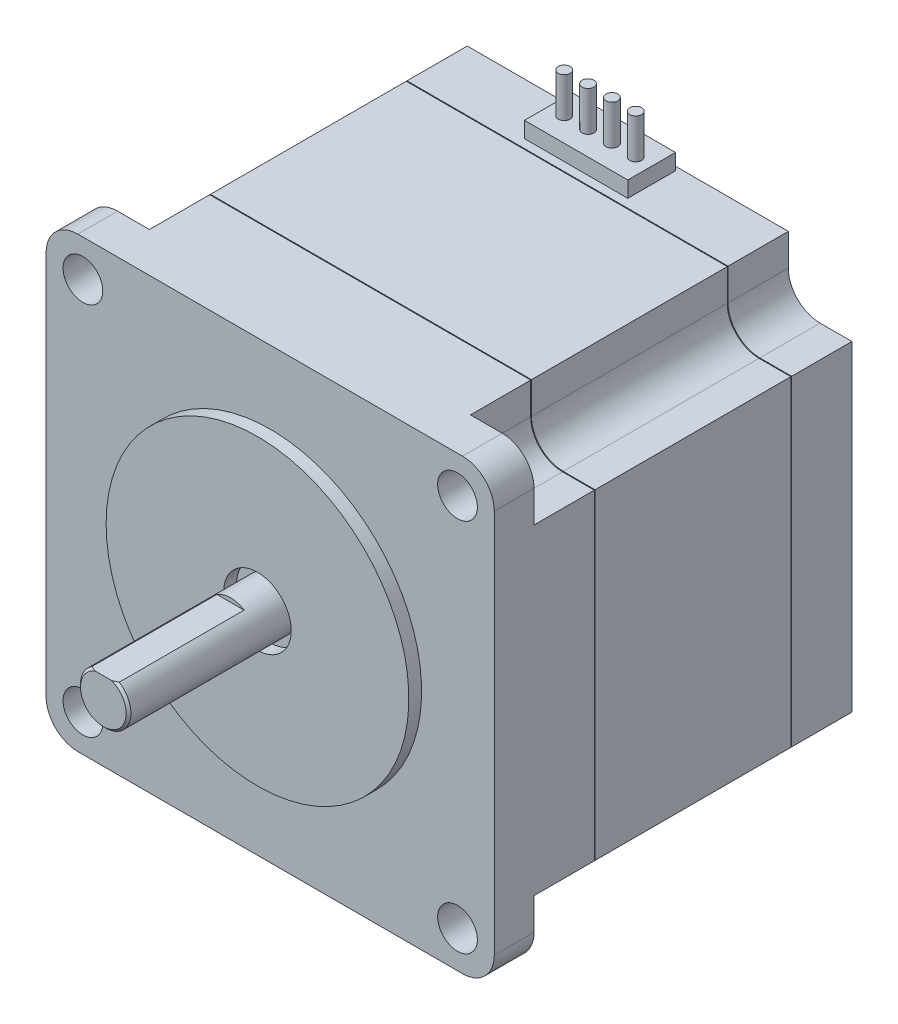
ISO-10303-21;
HEADER;
FILE_DESCRIPTION(('STEP AP214'),'2;1');
FILE_NAME('part.step','',(''),(''),'','','');
FILE_SCHEMA(('AUTOMOTIVE_DESIGN { 1 0 10303 214 1 1 1 1 }'));
ENDSEC;
DATA;
#1=APPLICATION_CONTEXT('core data for automotive mechanical design processes');
#2=APPLICATION_PROTOCOL_DEFINITION('international standard','automotive_design',2000,#1);
#3=PRODUCT_CONTEXT('',#1,'mechanical');
#4=PRODUCT('Part','Part','',(#3));
#5=PRODUCT_RELATED_PRODUCT_CATEGORY('part','',(#4));
#6=PRODUCT_DEFINITION_FORMATION('','',#4);
#7=PRODUCT_DEFINITION_CONTEXT('part definition',#1,'design');
#8=PRODUCT_DEFINITION('design','',#6,#7);
#9=PRODUCT_DEFINITION_SHAPE('','',#8);
#10=(LENGTH_UNIT() NAMED_UNIT(*) SI_UNIT(.MILLI.,.METRE.));
#11=(NAMED_UNIT(*) PLANE_ANGLE_UNIT() SI_UNIT($,.RADIAN.));
#12=(NAMED_UNIT(*) SI_UNIT($,.STERADIAN.) SOLID_ANGLE_UNIT());
#13=UNCERTAINTY_MEASURE_WITH_UNIT(LENGTH_MEASURE(1.E-05),#10,'distance_accuracy_value','');
#14=(GEOMETRIC_REPRESENTATION_CONTEXT(3) GLOBAL_UNCERTAINTY_ASSIGNED_CONTEXT((#13)) GLOBAL_UNIT_ASSIGNED_CONTEXT((#10,
#11,#12)) REPRESENTATION_CONTEXT('',''));
#15=CARTESIAN_POINT('',(0.,0.,0.));
#16=DIRECTION('',(0.,0.,1.));
#17=DIRECTION('',(1.,0.,0.));
#18=AXIS2_PLACEMENT_3D('',#15,#16,#17);
#19=CARTESIAN_POINT('',(-28.2,28.2000000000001,7.6815));
#20=DIRECTION('',(0.,0.,1.));
#21=DIRECTION('',(0.,-1.,0.));
#22=AXIS2_PLACEMENT_3D('',#19,#20,#21);
#23=PLANE('',#22);
#24=DIRECTION('',(0.,1.,0.));
#25=VECTOR('',#24,1.);
#26=CARTESIAN_POINT('',(-20.1999999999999,-28.2,7.68149999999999));
#27=LINE('',#26,#25);
#28=CARTESIAN_POINT('',(-20.1999999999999,-28.1999999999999,7.68149999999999));
#29=VERTEX_POINT('',#28);
#30=CARTESIAN_POINT('',(-20.1999999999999,-24.2,7.68149999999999));
#31=VERTEX_POINT('',#30);
#32=EDGE_CURVE('P0_E104',#29,#31,#27,.T.);
#33=ORIENTED_EDGE('',*,*,#32,.T.);
#34=CARTESIAN_POINT('',(-24.1999999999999,-24.2,7.68149999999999));
#35=DIRECTION('',(0.,0.,1.));
#36=DIRECTION('',(1.,0.,0.));
#37=AXIS2_PLACEMENT_3D('',#34,#35,#36);
#38=CIRCLE('',#37,4.);
#39=CARTESIAN_POINT('',(-24.1999999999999,-20.2,7.68149999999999));
#40=VERTEX_POINT('',#39);
#41=EDGE_CURVE('P0_E20',#31,#40,#38,.T.);
#42=ORIENTED_EDGE('',*,*,#41,.T.);
#43=DIRECTION('',(-1.,0.,0.));
#44=VECTOR('',#43,1.);
#45=CARTESIAN_POINT('',(-20.2,-20.2,7.68149999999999));
#46=LINE('',#45,#44);
#47=CARTESIAN_POINT('',(-28.1999999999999,-20.1999999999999,7.68149999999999));
#48=VERTEX_POINT('',#47);
#49=EDGE_CURVE('P0_E264',#40,#48,#46,.T.);
#50=ORIENTED_EDGE('',*,*,#49,.T.);
#51=DIRECTION('',(0.,1.,0.));
#52=VECTOR('',#51,1.);
#53=CARTESIAN_POINT('',(-28.1999999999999,-20.2,7.68149999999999));
#54=LINE('',#53,#52);
#55=CARTESIAN_POINT('',(-28.2,20.2,7.6815));
#56=VERTEX_POINT('',#55);
#57=EDGE_CURVE('P0_E259',#48,#56,#54,.T.);
#58=ORIENTED_EDGE('',*,*,#57,.T.);
#59=DIRECTION('',(1.,0.,0.));
#60=VECTOR('',#59,1.);
#61=CARTESIAN_POINT('',(-28.1999999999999,20.2,7.6815));
#62=LINE('',#61,#60);
#63=CARTESIAN_POINT('',(-24.2,20.2,7.6815));
#64=VERTEX_POINT('',#63);
#65=EDGE_CURVE('P0_E249',#56,#64,#62,.T.);
#66=ORIENTED_EDGE('',*,*,#65,.T.);
#67=CARTESIAN_POINT('',(-24.2,24.2,7.6815));
#68=DIRECTION('',(0.,0.,1.));
#69=DIRECTION('',(1.,0.,0.));
#70=AXIS2_PLACEMENT_3D('',#67,#68,#69);
#71=CIRCLE('',#70,4.);
#72=CARTESIAN_POINT('',(-20.2,24.2,7.6815));
#73=VERTEX_POINT('',#72);
#74=EDGE_CURVE('P0_E245',#64,#73,#71,.T.);
#75=ORIENTED_EDGE('',*,*,#74,.T.);
#76=DIRECTION('',(0.,1.,0.));
#77=VECTOR('',#76,1.);
#78=CARTESIAN_POINT('',(-20.2,20.2,7.6815));
#79=LINE('',#78,#77);
#80=CARTESIAN_POINT('',(-20.2,28.2,7.6815));
#81=VERTEX_POINT('',#80);
#82=EDGE_CURVE('P0_E241',#73,#81,#79,.T.);
#83=ORIENTED_EDGE('',*,*,#82,.T.);
#84=DIRECTION('',(1.,0.,0.));
#85=VECTOR('',#84,1.);
#86=CARTESIAN_POINT('',(-20.2,28.2,7.6815));
#87=LINE('',#86,#85);
#88=CARTESIAN_POINT('',(20.2,28.2,7.6815));
#89=VERTEX_POINT('',#88);
#90=EDGE_CURVE('P0_E235',#81,#89,#87,.T.);
#91=ORIENTED_EDGE('',*,*,#90,.T.);
#92=DIRECTION('',(0.,-1.,0.));
#93=VECTOR('',#92,1.);
#94=CARTESIAN_POINT('',(20.2,28.2,7.6815));
#95=LINE('',#94,#93);
#96=CARTESIAN_POINT('',(20.2,24.2,7.6815));
#97=VERTEX_POINT('',#96);
#98=EDGE_CURVE('P0_E225',#89,#97,#95,.T.);
#99=ORIENTED_EDGE('',*,*,#98,.T.);
#100=CARTESIAN_POINT('',(24.2,24.2,7.6815));
#101=DIRECTION('',(0.,0.,1.));
#102=DIRECTION('',(1.,0.,0.));
#103=AXIS2_PLACEMENT_3D('',#100,#101,#102);
#104=CIRCLE('',#103,4.);
#105=CARTESIAN_POINT('',(24.2,20.2,7.6815));
#106=VERTEX_POINT('',#105);
#107=EDGE_CURVE('P0_E221',#97,#106,#104,.T.);
#108=ORIENTED_EDGE('',*,*,#107,.T.);
#109=DIRECTION('',(1.,0.,0.));
#110=VECTOR('',#109,1.);
#111=CARTESIAN_POINT('',(20.2,20.2,7.6815));
#112=LINE('',#111,#110);
#113=CARTESIAN_POINT('',(28.2,20.2,7.68150000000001));
#114=VERTEX_POINT('',#113);
#115=EDGE_CURVE('P0_E217',#106,#114,#112,.T.);
#116=ORIENTED_EDGE('',*,*,#115,.T.);
#117=DIRECTION('',(0.,-1.,0.));
#118=VECTOR('',#117,1.);
#119=CARTESIAN_POINT('',(28.2,20.2,7.68150000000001));
#120=LINE('',#119,#118);
#121=CARTESIAN_POINT('',(28.1999999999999,-20.2,7.6815));
#122=VERTEX_POINT('',#121);
#123=EDGE_CURVE('P0_E141',#114,#122,#120,.T.);
#124=ORIENTED_EDGE('',*,*,#123,.T.);
#125=DIRECTION('',(-1.,0.,0.));
#126=VECTOR('',#125,1.);
#127=CARTESIAN_POINT('',(28.1999999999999,-20.2,7.68149999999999));
#128=LINE('',#127,#126);
#129=CARTESIAN_POINT('',(24.2,-20.2,7.68149999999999));
#130=VERTEX_POINT('',#129);
#131=EDGE_CURVE('P0_E145',#122,#130,#128,.T.);
#132=ORIENTED_EDGE('',*,*,#131,.T.);
#133=CARTESIAN_POINT('',(24.2,-24.2,7.68149999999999));
#134=DIRECTION('',(0.,0.,1.));
#135=DIRECTION('',(1.,0.,0.));
#136=AXIS2_PLACEMENT_3D('',#133,#134,#135);
#137=CIRCLE('',#136,4.);
#138=CARTESIAN_POINT('',(20.2,-24.2,7.68149999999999));
#139=VERTEX_POINT('',#138);
#140=EDGE_CURVE('P0_E206',#130,#139,#137,.T.);
#141=ORIENTED_EDGE('',*,*,#140,.T.);
#142=DIRECTION('',(0.,-1.,0.));
#143=VECTOR('',#142,1.);
#144=CARTESIAN_POINT('',(20.2,-20.2,7.68149999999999));
#145=LINE('',#144,#143);
#146=CARTESIAN_POINT('',(20.2,-28.2,7.68149999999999));
#147=VERTEX_POINT('',#146);
#148=EDGE_CURVE('P0_E286',#139,#147,#145,.T.);
#149=ORIENTED_EDGE('',*,*,#148,.T.);
#150=DIRECTION('',(1.,0.,0.));
#151=VECTOR('',#150,1.);
#152=CARTESIAN_POINT('',(20.2,-28.2,7.68149999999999));
#153=LINE('',#152,#151);
#154=EDGE_CURVE('P0_E279',#147,#29,#153,.F.);
#155=ORIENTED_EDGE('',*,*,#154,.T.);
#156=EDGE_LOOP('',(#33,#42,#50,#58,#66,#75,#83,#91,#99,#108,#116,#124,#132,#141,#149,#155));
#157=FACE_BOUND('',#156,.T.);
#158=ADVANCED_FACE('P0_F17',(#157),#23,.F.);
#159=CARTESIAN_POINT('',(20.2,-20.2,45.));
#160=DIRECTION('',(-1.,0.,0.));
#161=DIRECTION('',(0.,-1.,0.));
#162=AXIS2_PLACEMENT_3D('',#159,#160,#161);
#163=PLANE('',#162);
#164=DIRECTION('',(0.,1.,0.));
#165=VECTOR('',#164,1.);
#166=CARTESIAN_POINT('',(20.2,28.2000000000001,32.3185));
#167=LINE('',#166,#165);
#168=CARTESIAN_POINT('',(20.2,-24.2,32.3185));
#169=VERTEX_POINT('',#168);
#170=CARTESIAN_POINT('',(20.2,-28.2,32.3185));
#171=VERTEX_POINT('',#170);
#172=EDGE_CURVE('P0_E198',#169,#171,#167,.F.);
#173=ORIENTED_EDGE('',*,*,#172,.T.);
#174=DIRECTION('',(0.,0.,1.));
#175=VECTOR('',#174,1.);
#176=CARTESIAN_POINT('',(20.2,-28.2,45.));
#177=LINE('',#176,#175);
#178=EDGE_CURVE('P0_E276',#171,#147,#177,.F.);
#179=ORIENTED_EDGE('',*,*,#178,.T.);
#180=ORIENTED_EDGE('',*,*,#148,.F.);
#181=DIRECTION('',(0.,0.,1.));
#182=VECTOR('',#181,1.);
#183=CARTESIAN_POINT('',(20.2,-24.2,45.));
#184=LINE('',#183,#182);
#185=EDGE_CURVE('P0_E203',#139,#169,#184,.T.);
#186=ORIENTED_EDGE('',*,*,#185,.T.);
#187=EDGE_LOOP('',(#173,#179,#180,#186));
#188=FACE_BOUND('',#187,.T.);
#189=ADVANCED_FACE('P0_F488',(#188),#163,.F.);
#190=CARTESIAN_POINT('',(20.2,-28.2,45.));
#191=DIRECTION('',(0.,1.,0.));
#192=DIRECTION('',(0.,0.,1.));
#193=AXIS2_PLACEMENT_3D('',#190,#191,#192);
#194=PLANE('',#193);
#195=DIRECTION('',(1.,0.,0.));
#196=VECTOR('',#195,1.);
#197=CARTESIAN_POINT('',(-28.2,-28.2,32.3185));
#198=LINE('',#197,#196);
#199=CARTESIAN_POINT('',(-20.1999999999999,-28.2,32.3185));
#200=VERTEX_POINT('',#199);
#201=EDGE_CURVE('P0_E195',#171,#200,#198,.F.);
#202=ORIENTED_EDGE('',*,*,#201,.T.);
#203=DIRECTION('',(0.,0.,1.));
#204=VECTOR('',#203,1.);
#205=CARTESIAN_POINT('',(-20.1999999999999,-28.1999999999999,45.));
#206=LINE('',#205,#204);
#207=EDGE_CURVE('P0_E267',#200,#29,#206,.F.);
#208=ORIENTED_EDGE('',*,*,#207,.T.);
#209=ORIENTED_EDGE('',*,*,#154,.F.);
#210=ORIENTED_EDGE('',*,*,#178,.F.);
#211=EDGE_LOOP('',(#202,#208,#209,#210));
#212=FACE_BOUND('',#211,.T.);
#213=ADVANCED_FACE('P0_F480',(#212),#194,.F.);
#214=CARTESIAN_POINT('',(-20.1999999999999,-28.2,45.));
#215=DIRECTION('',(1.,0.,0.));
#216=DIRECTION('',(0.,1.,0.));
#217=AXIS2_PLACEMENT_3D('',#214,#215,#216);
#218=PLANE('',#217);
#219=DIRECTION('',(0.,1.,0.));
#220=VECTOR('',#219,1.);
#221=CARTESIAN_POINT('',(-20.1999999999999,28.2000000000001,32.3185));
#222=LINE('',#221,#220);
#223=CARTESIAN_POINT('',(-20.1999999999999,-24.2,32.3185));
#224=VERTEX_POINT('',#223);
#225=EDGE_CURVE('P0_E192',#200,#224,#222,.T.);
#226=ORIENTED_EDGE('',*,*,#225,.T.);
#227=DIRECTION('',(0.,0.,1.));
#228=VECTOR('',#227,1.);
#229=CARTESIAN_POINT('',(-20.1999999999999,-24.2,45.));
#230=LINE('',#229,#228);
#231=EDGE_CURVE('P0_E265',#224,#31,#230,.F.);
#232=ORIENTED_EDGE('',*,*,#231,.T.);
#233=ORIENTED_EDGE('',*,*,#32,.F.);
#234=ORIENTED_EDGE('',*,*,#207,.F.);
#235=EDGE_LOOP('',(#226,#232,#233,#234));
#236=FACE_BOUND('',#235,.T.);
#237=ADVANCED_FACE('P0_F472',(#236),#218,.F.);
#238=CARTESIAN_POINT('',(-24.1999999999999,-24.2,45.));
#239=DIRECTION('',(0.,0.,1.));
#240=DIRECTION('',(1.,0.,0.));
#241=AXIS2_PLACEMENT_3D('',#238,#239,#240);
#242=CYLINDRICAL_SURFACE('',#241,4.);
#243=CARTESIAN_POINT('',(-24.1999999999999,-24.2,32.3185));
#244=DIRECTION('',(0.,0.,1.));
#245=DIRECTION('',(1.,0.,0.));
#246=AXIS2_PLACEMENT_3D('',#243,#244,#245);
#247=CIRCLE('',#246,4.);
#248=CARTESIAN_POINT('',(-24.1999999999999,-20.2,32.3185));
#249=VERTEX_POINT('',#248);
#250=EDGE_CURVE('P0_E189',#224,#249,#247,.T.);
#251=ORIENTED_EDGE('',*,*,#250,.T.);
#252=DIRECTION('',(0.,0.,1.));
#253=VECTOR('',#252,1.);
#254=CARTESIAN_POINT('',(-24.1999999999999,-20.2,45.));
#255=LINE('',#254,#253);
#256=EDGE_CURVE('P0_E262',#249,#40,#255,.F.);
#257=ORIENTED_EDGE('',*,*,#256,.T.);
#258=ORIENTED_EDGE('',*,*,#41,.F.);
#259=ORIENTED_EDGE('',*,*,#231,.F.);
#260=EDGE_LOOP('',(#251,#257,#258,#259));
#261=FACE_BOUND('',#260,.T.);
#262=ADVANCED_FACE('P0_F463',(#261),#242,.F.);
#263=CARTESIAN_POINT('',(-20.2,-20.2,45.));
#264=DIRECTION('',(0.,1.,0.));
#265=DIRECTION('',(-1.,0.,0.));
#266=AXIS2_PLACEMENT_3D('',#263,#264,#265);
#267=PLANE('',#266);
#268=DIRECTION('',(1.,0.,0.));
#269=VECTOR('',#268,1.);
#270=CARTESIAN_POINT('',(-28.2,-20.2,32.3185));
#271=LINE('',#270,#269);
#272=CARTESIAN_POINT('',(-28.2,-20.2,32.3185));
#273=VERTEX_POINT('',#272);
#274=EDGE_CURVE('P0_E186',#249,#273,#271,.F.);
#275=ORIENTED_EDGE('',*,*,#274,.T.);
#276=DIRECTION('',(0.,0.,1.));
#277=VECTOR('',#276,1.);
#278=CARTESIAN_POINT('',(-28.1999999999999,-20.1999999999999,45.));
#279=LINE('',#278,#277);
#280=EDGE_CURVE('P0_E256',#273,#48,#279,.F.);
#281=ORIENTED_EDGE('',*,*,#280,.T.);
#282=ORIENTED_EDGE('',*,*,#49,.F.);
#283=ORIENTED_EDGE('',*,*,#256,.F.);
#284=EDGE_LOOP('',(#275,#281,#282,#283));
#285=FACE_BOUND('',#284,.T.);
#286=ADVANCED_FACE('P0_F454',(#285),#267,.F.);
#287=CARTESIAN_POINT('',(-28.1999999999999,-20.2,45.));
#288=DIRECTION('',(1.,0.,0.));
#289=DIRECTION('',(0.,1.,0.));
#290=AXIS2_PLACEMENT_3D('',#287,#288,#289);
#291=PLANE('',#290);
#292=DIRECTION('',(0.,1.,0.));
#293=VECTOR('',#292,1.);
#294=CARTESIAN_POINT('',(-28.2,28.2000000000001,32.3185));
#295=LINE('',#294,#293);
#296=CARTESIAN_POINT('',(-28.2,20.2,32.3185));
#297=VERTEX_POINT('',#296);
#298=EDGE_CURVE('P0_E183',#273,#297,#295,.T.);
#299=ORIENTED_EDGE('',*,*,#298,.T.);
#300=DIRECTION('',(0.,0.,1.));
#301=VECTOR('',#300,1.);
#302=CARTESIAN_POINT('',(-28.2,20.2,45.));
#303=LINE('',#302,#301);
#304=EDGE_CURVE('P0_E246',#297,#56,#303,.F.);
#305=ORIENTED_EDGE('',*,*,#304,.T.);
#306=ORIENTED_EDGE('',*,*,#57,.F.);
#307=ORIENTED_EDGE('',*,*,#280,.F.);
#308=EDGE_LOOP('',(#299,#305,#306,#307));
#309=FACE_BOUND('',#308,.T.);
#310=ADVANCED_FACE('P0_F445',(#309),#291,.F.);
#311=CARTESIAN_POINT('',(-28.1999999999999,20.2,45.));
#312=DIRECTION('',(0.,-1.,0.));
#313=DIRECTION('',(1.,0.,0.));
#314=AXIS2_PLACEMENT_3D('',#311,#312,#313);
#315=PLANE('',#314);
#316=DIRECTION('',(1.,0.,0.));
#317=VECTOR('',#316,1.);
#318=CARTESIAN_POINT('',(-28.2,20.2,32.3185));
#319=LINE('',#318,#317);
#320=CARTESIAN_POINT('',(-24.2,20.2,32.3185));
#321=VERTEX_POINT('',#320);
#322=EDGE_CURVE('P0_E180',#297,#321,#319,.T.);
#323=ORIENTED_EDGE('',*,*,#322,.T.);
#324=DIRECTION('',(0.,0.,1.));
#325=VECTOR('',#324,1.);
#326=CARTESIAN_POINT('',(-24.2,20.2,45.));
#327=LINE('',#326,#325);
#328=EDGE_CURVE('P0_E242',#321,#64,#327,.F.);
#329=ORIENTED_EDGE('',*,*,#328,.T.);
#330=ORIENTED_EDGE('',*,*,#65,.F.);
#331=ORIENTED_EDGE('',*,*,#304,.F.);
#332=EDGE_LOOP('',(#323,#329,#330,#331));
#333=FACE_BOUND('',#332,.T.);
#334=ADVANCED_FACE('P0_F437',(#333),#315,.F.);
#335=CARTESIAN_POINT('',(-24.2,24.2,45.));
#336=DIRECTION('',(0.,0.,1.));
#337=DIRECTION('',(1.,0.,0.));
#338=AXIS2_PLACEMENT_3D('',#335,#336,#337);
#339=CYLINDRICAL_SURFACE('',#338,4.);
#340=CARTESIAN_POINT('',(-24.2,24.2,32.3185));
#341=DIRECTION('',(0.,0.,1.));
#342=DIRECTION('',(1.,0.,0.));
#343=AXIS2_PLACEMENT_3D('',#340,#341,#342);
#344=CIRCLE('',#343,4.);
#345=CARTESIAN_POINT('',(-20.2,24.2,32.3185));
#346=VERTEX_POINT('',#345);
#347=EDGE_CURVE('P0_E177',#321,#346,#344,.T.);
#348=ORIENTED_EDGE('',*,*,#347,.T.);
#349=DIRECTION('',(0.,0.,-1.));
#350=VECTOR('',#349,1.);
#351=CARTESIAN_POINT('',(-20.2,24.2,45.));
#352=LINE('',#351,#350);
#353=EDGE_CURVE('P0_E238',#346,#73,#352,.T.);
#354=ORIENTED_EDGE('',*,*,#353,.T.);
#355=ORIENTED_EDGE('',*,*,#74,.F.);
#356=ORIENTED_EDGE('',*,*,#328,.F.);
#357=EDGE_LOOP('',(#348,#354,#355,#356));
#358=FACE_BOUND('',#357,.T.);
#359=ADVANCED_FACE('P0_F337',(#358),#339,.F.);
#360=CARTESIAN_POINT('',(-20.2,20.2,45.));
#361=DIRECTION('',(1.,0.,0.));
#362=DIRECTION('',(0.,0.,-1.));
#363=AXIS2_PLACEMENT_3D('',#360,#361,#362);
#364=PLANE('',#363);
#365=DIRECTION('',(0.,1.,0.));
#366=VECTOR('',#365,1.);
#367=CARTESIAN_POINT('',(-20.2,28.2000000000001,32.3185));
#368=LINE('',#367,#366);
#369=CARTESIAN_POINT('',(-20.2,28.2000000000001,32.3185));
#370=VERTEX_POINT('',#369);
#371=EDGE_CURVE('P0_E174',#346,#370,#368,.T.);
#372=ORIENTED_EDGE('',*,*,#371,.T.);
#373=DIRECTION('',(0.,0.,1.));
#374=VECTOR('',#373,1.);
#375=CARTESIAN_POINT('',(-20.2,28.2,45.));
#376=LINE('',#375,#374);
#377=EDGE_CURVE('P0_E232',#370,#81,#376,.F.);
#378=ORIENTED_EDGE('',*,*,#377,.T.);
#379=ORIENTED_EDGE('',*,*,#82,.F.);
#380=ORIENTED_EDGE('',*,*,#353,.F.);
#381=EDGE_LOOP('',(#372,#378,#379,#380));
#382=FACE_BOUND('',#381,.T.);
#383=ADVANCED_FACE('P0_F341',(#382),#364,.F.);
#384=CARTESIAN_POINT('',(-20.2,28.2,45.));
#385=DIRECTION('',(0.,-1.,0.));
#386=DIRECTION('',(1.,0.,0.));
#387=AXIS2_PLACEMENT_3D('',#384,#385,#386);
#388=PLANE('',#387);
#389=DIRECTION('',(1.,0.,0.));
#390=VECTOR('',#389,1.);
#391=CARTESIAN_POINT('',(-28.2,28.2000000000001,32.3185));
#392=LINE('',#391,#390);
#393=CARTESIAN_POINT('',(20.2,28.2,32.3185));
#394=VERTEX_POINT('',#393);
#395=EDGE_CURVE('P0_E171',#370,#394,#392,.T.);
#396=ORIENTED_EDGE('',*,*,#395,.T.);
#397=DIRECTION('',(0.,0.,1.));
#398=VECTOR('',#397,1.);
#399=CARTESIAN_POINT('',(20.2,28.2,45.));
#400=LINE('',#399,#398);
#401=EDGE_CURVE('P0_E222',#394,#89,#400,.F.);
#402=ORIENTED_EDGE('',*,*,#401,.T.);
#403=ORIENTED_EDGE('',*,*,#90,.F.);
#404=ORIENTED_EDGE('',*,*,#377,.F.);
#405=EDGE_LOOP('',(#396,#402,#403,#404));
#406=FACE_BOUND('',#405,.T.);
#407=ADVANCED_FACE('P0_F346',(#406),#388,.F.);
#408=CARTESIAN_POINT('',(20.2,28.2,45.));
#409=DIRECTION('',(-1.,0.,0.));
#410=DIRECTION('',(0.,-1.,0.));
#411=AXIS2_PLACEMENT_3D('',#408,#409,#410);
#412=PLANE('',#411);
#413=DIRECTION('',(0.,1.,0.));
#414=VECTOR('',#413,1.);
#415=CARTESIAN_POINT('',(20.2,28.2000000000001,32.3185));
#416=LINE('',#415,#414);
#417=CARTESIAN_POINT('',(20.2,24.2,32.3185));
#418=VERTEX_POINT('',#417);
#419=EDGE_CURVE('P0_E161',#394,#418,#416,.F.);
#420=ORIENTED_EDGE('',*,*,#419,.T.);
#421=DIRECTION('',(0.,0.,1.));
#422=VECTOR('',#421,1.);
#423=CARTESIAN_POINT('',(20.2,24.2,45.));
#424=LINE('',#423,#422);
#425=EDGE_CURVE('P0_E218',#418,#97,#424,.F.);
#426=ORIENTED_EDGE('',*,*,#425,.T.);
#427=ORIENTED_EDGE('',*,*,#98,.F.);
#428=ORIENTED_EDGE('',*,*,#401,.F.);
#429=EDGE_LOOP('',(#420,#426,#427,#428));
#430=FACE_BOUND('',#429,.T.);
#431=ADVANCED_FACE('P0_F348',(#430),#412,.F.);
#432=CARTESIAN_POINT('',(24.2,24.2,45.));
#433=DIRECTION('',(0.,0.,1.));
#434=DIRECTION('',(1.,0.,0.));
#435=AXIS2_PLACEMENT_3D('',#432,#433,#434);
#436=CYLINDRICAL_SURFACE('',#435,4.);
#437=CARTESIAN_POINT('',(24.2,24.2,32.3185));
#438=DIRECTION('',(0.,0.,1.));
#439=DIRECTION('',(1.,0.,0.));
#440=AXIS2_PLACEMENT_3D('',#437,#438,#439);
#441=CIRCLE('',#440,4.);
#442=CARTESIAN_POINT('',(24.2,20.2,32.3185));
#443=VERTEX_POINT('',#442);
#444=EDGE_CURVE('P0_E159',#418,#443,#441,.T.);
#445=ORIENTED_EDGE('',*,*,#444,.T.);
#446=DIRECTION('',(0.,0.,1.));
#447=VECTOR('',#446,1.);
#448=CARTESIAN_POINT('',(24.2,20.2,45.));
#449=LINE('',#448,#447);
#450=EDGE_CURVE('P0_E158',#443,#106,#449,.F.);
#451=ORIENTED_EDGE('',*,*,#450,.T.);
#452=ORIENTED_EDGE('',*,*,#107,.F.);
#453=ORIENTED_EDGE('',*,*,#425,.F.);
#454=EDGE_LOOP('',(#445,#451,#452,#453));
#455=FACE_BOUND('',#454,.T.);
#456=ADVANCED_FACE('P0_F350',(#455),#436,.F.);
#457=CARTESIAN_POINT('',(20.2,20.2,45.));
#458=DIRECTION('',(0.,-1.,0.));
#459=DIRECTION('',(1.,0.,0.));
#460=AXIS2_PLACEMENT_3D('',#457,#458,#459);
#461=PLANE('',#460);
#462=DIRECTION('',(1.,0.,0.));
#463=VECTOR('',#462,1.);
#464=CARTESIAN_POINT('',(-28.2,20.2,32.3185));
#465=LINE('',#464,#463);
#466=CARTESIAN_POINT('',(28.2,20.2,32.3185));
#467=VERTEX_POINT('',#466);
#468=EDGE_CURVE('P0_E152',#443,#467,#465,.T.);
#469=ORIENTED_EDGE('',*,*,#468,.T.);
#470=DIRECTION('',(0.,0.,1.));
#471=VECTOR('',#470,1.);
#472=CARTESIAN_POINT('',(28.2,20.2,45.));
#473=LINE('',#472,#471);
#474=EDGE_CURVE('P0_E135',#467,#114,#473,.F.);
#475=ORIENTED_EDGE('',*,*,#474,.T.);
#476=ORIENTED_EDGE('',*,*,#115,.F.);
#477=ORIENTED_EDGE('',*,*,#450,.F.);
#478=EDGE_LOOP('',(#469,#475,#476,#477));
#479=FACE_BOUND('',#478,.T.);
#480=ADVANCED_FACE('P0_F156',(#479),#461,.F.);
#481=CARTESIAN_POINT('',(28.2,20.2,45.));
#482=DIRECTION('',(-1.,0.,0.));
#483=DIRECTION('',(0.,-1.,0.));
#484=AXIS2_PLACEMENT_3D('',#481,#482,#483);
#485=PLANE('',#484);
#486=DIRECTION('',(0.,1.,0.));
#487=VECTOR('',#486,1.);
#488=CARTESIAN_POINT('',(28.2,28.2000000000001,32.3185));
#489=LINE('',#488,#487);
#490=CARTESIAN_POINT('',(28.2,-20.2,32.3185));
#491=VERTEX_POINT('',#490);
#492=EDGE_CURVE('P0_E139',#467,#491,#489,.F.);
#493=ORIENTED_EDGE('',*,*,#492,.T.);
#494=DIRECTION('',(0.,0.,1.));
#495=VECTOR('',#494,1.);
#496=CARTESIAN_POINT('',(28.1999999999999,-20.2,45.));
#497=LINE('',#496,#495);
#498=EDGE_CURVE('P0_E208',#491,#122,#497,.F.);
#499=ORIENTED_EDGE('',*,*,#498,.T.);
#500=ORIENTED_EDGE('',*,*,#123,.F.);
#501=ORIENTED_EDGE('',*,*,#474,.F.);
#502=EDGE_LOOP('',(#493,#499,#500,#501));
#503=FACE_BOUND('',#502,.T.);
#504=ADVANCED_FACE('P0_F137',(#503),#485,.F.);
#505=CARTESIAN_POINT('',(28.1999999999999,-20.2,45.));
#506=DIRECTION('',(0.,1.,0.));
#507=DIRECTION('',(-1.,0.,0.));
#508=AXIS2_PLACEMENT_3D('',#505,#506,#507);
#509=PLANE('',#508);
#510=DIRECTION('',(1.,0.,0.));
#511=VECTOR('',#510,1.);
#512=CARTESIAN_POINT('',(-28.2,-20.2,32.3185));
#513=LINE('',#512,#511);
#514=CARTESIAN_POINT('',(24.2,-20.2,32.3185));
#515=VERTEX_POINT('',#514);
#516=EDGE_CURVE('P0_E26',#491,#515,#513,.F.);
#517=ORIENTED_EDGE('',*,*,#516,.T.);
#518=DIRECTION('',(0.,0.,1.));
#519=VECTOR('',#518,1.);
#520=CARTESIAN_POINT('',(24.2,-20.2,45.));
#521=LINE('',#520,#519);
#522=EDGE_CURVE('P0_E34',#515,#130,#521,.F.);
#523=ORIENTED_EDGE('',*,*,#522,.T.);
#524=ORIENTED_EDGE('',*,*,#131,.F.);
#525=ORIENTED_EDGE('',*,*,#498,.F.);
#526=EDGE_LOOP('',(#517,#523,#524,#525));
#527=FACE_BOUND('',#526,.T.);
#528=ADVANCED_FACE('P0_F366',(#527),#509,.F.);
#529=CARTESIAN_POINT('',(24.2,-24.2,45.));
#530=DIRECTION('',(0.,0.,1.));
#531=DIRECTION('',(1.,0.,0.));
#532=AXIS2_PLACEMENT_3D('',#529,#530,#531);
#533=CYLINDRICAL_SURFACE('',#532,4.);
#534=CARTESIAN_POINT('',(24.2,-24.2,32.3185));
#535=DIRECTION('',(0.,0.,1.));
#536=DIRECTION('',(1.,0.,0.));
#537=AXIS2_PLACEMENT_3D('',#534,#535,#536);
#538=CIRCLE('',#537,4.);
#539=EDGE_CURVE('P0_E11',#515,#169,#538,.T.);
#540=ORIENTED_EDGE('',*,*,#539,.T.);
#541=ORIENTED_EDGE('',*,*,#185,.F.);
#542=ORIENTED_EDGE('',*,*,#140,.F.);
#543=ORIENTED_EDGE('',*,*,#522,.F.);
#544=EDGE_LOOP('',(#540,#541,#542,#543));
#545=FACE_BOUND('',#544,.T.);
#546=ADVANCED_FACE('P0_F361',(#545),#533,.F.);
#547=CARTESIAN_POINT('',(-28.2,28.2000000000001,32.3185));
#548=DIRECTION('',(0.,0.,-1.));
#549=DIRECTION('',(0.,1.,0.));
#550=AXIS2_PLACEMENT_3D('',#547,#548,#549);
#551=PLANE('',#550);
#552=ORIENTED_EDGE('',*,*,#516,.F.);
#553=ORIENTED_EDGE('',*,*,#492,.F.);
#554=ORIENTED_EDGE('',*,*,#468,.F.);
#555=ORIENTED_EDGE('',*,*,#444,.F.);
#556=ORIENTED_EDGE('',*,*,#419,.F.);
#557=ORIENTED_EDGE('',*,*,#395,.F.);
#558=ORIENTED_EDGE('',*,*,#371,.F.);
#559=ORIENTED_EDGE('',*,*,#347,.F.);
#560=ORIENTED_EDGE('',*,*,#322,.F.);
#561=ORIENTED_EDGE('',*,*,#298,.F.);
#562=ORIENTED_EDGE('',*,*,#274,.F.);
#563=ORIENTED_EDGE('',*,*,#250,.F.);
#564=ORIENTED_EDGE('',*,*,#225,.F.);
#565=ORIENTED_EDGE('',*,*,#201,.F.);
#566=ORIENTED_EDGE('',*,*,#172,.F.);
#567=ORIENTED_EDGE('',*,*,#539,.F.);
#568=EDGE_LOOP('',(#552,#553,#554,#555,#556,#557,#558,#559,#560,#561,#562,#563,#564,#565,#566,#567));
#569=FACE_BOUND('',#568,.T.);
#570=ADVANCED_FACE('P0_F150',(#569),#551,.F.);
#571=CLOSED_SHELL('',(#158,#189,#213,#237,#262,#286,#310,#334,#359,#383,#407,#431,#456,#480,
#504,#528,#546,#570));
#572=MANIFOLD_SOLID_BREP('P0_B1',#571);
#573=CARTESIAN_POINT('',(1.5,35.2,3.49999999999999));
#574=DIRECTION('',(0.,1.,0.));
#575=DIRECTION('',(0.,0.,1.));
#576=AXIS2_PLACEMENT_3D('',#573,#574,#575);
#577=PLANE('',#576);
#578=CARTESIAN_POINT('',(1.5,35.2,3.49999999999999));
#579=DIRECTION('',(0.,-1.,0.));
#580=DIRECTION('',(0.,0.,-1.));
#581=AXIS2_PLACEMENT_3D('',#578,#579,#580);
#582=CIRCLE('',#581,0.75);
#583=CARTESIAN_POINT('',(1.5,35.2,2.74999999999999));
#584=VERTEX_POINT('',#583);
#585=EDGE_CURVE('P1_E20',#584,#584,#582,.T.);
#586=ORIENTED_EDGE('',*,*,#585,.F.);
#587=EDGE_LOOP('',(#586));
#588=FACE_BOUND('',#587,.T.);
#589=ADVANCED_FACE('P1_F17',(#588),#577,.T.);
#590=CARTESIAN_POINT('',(-4.5,35.2,3.49999999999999));
#591=DIRECTION('',(0.,1.,0.));
#592=DIRECTION('',(0.,0.,1.));
#593=AXIS2_PLACEMENT_3D('',#590,#591,#592);
#594=PLANE('',#593);
#595=CARTESIAN_POINT('',(-4.5,35.2,3.49999999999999));
#596=DIRECTION('',(0.,-1.,0.));
#597=DIRECTION('',(0.,0.,-1.));
#598=AXIS2_PLACEMENT_3D('',#595,#596,#597);
#599=CIRCLE('',#598,0.75);
#600=CARTESIAN_POINT('',(-4.5,35.2,2.74999999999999));
#601=VERTEX_POINT('',#600);
#602=EDGE_CURVE('P1_E356',#601,#601,#599,.T.);
#603=ORIENTED_EDGE('',*,*,#602,.F.);
#604=EDGE_LOOP('',(#603));
#605=FACE_BOUND('',#604,.T.);
#606=ADVANCED_FACE('P1_F366',(#605),#594,.T.);
#607=CARTESIAN_POINT('',(-1.5,35.2,3.49999999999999));
#608=DIRECTION('',(0.,1.,0.));
#609=DIRECTION('',(0.,0.,1.));
#610=AXIS2_PLACEMENT_3D('',#607,#608,#609);
#611=PLANE('',#610);
#612=CARTESIAN_POINT('',(-1.5,35.2,3.49999999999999));
#613=DIRECTION('',(0.,-1.,0.));
#614=DIRECTION('',(0.,0.,-1.));
#615=AXIS2_PLACEMENT_3D('',#612,#613,#614);
#616=CIRCLE('',#615,0.75);
#617=CARTESIAN_POINT('',(-1.5,35.2,2.74999999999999));
#618=VERTEX_POINT('',#617);
#619=EDGE_CURVE('P1_E354',#618,#618,#616,.T.);
#620=ORIENTED_EDGE('',*,*,#619,.F.);
#621=EDGE_LOOP('',(#620));
#622=FACE_BOUND('',#621,.T.);
#623=ADVANCED_FACE('P1_F371',(#622),#611,.T.);
#624=CARTESIAN_POINT('',(4.5,35.2,3.49999999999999));
#625=DIRECTION('',(0.,1.,0.));
#626=DIRECTION('',(0.,0.,1.));
#627=AXIS2_PLACEMENT_3D('',#624,#625,#626);
#628=PLANE('',#627);
#629=CARTESIAN_POINT('',(4.5,35.2,3.49999999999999));
#630=DIRECTION('',(0.,-1.,0.));
#631=DIRECTION('',(0.,0.,-1.));
#632=AXIS2_PLACEMENT_3D('',#629,#630,#631);
#633=CIRCLE('',#632,0.75);
#634=CARTESIAN_POINT('',(4.5,35.2,2.74999999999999));
#635=VERTEX_POINT('',#634);
#636=EDGE_CURVE('P1_E351',#635,#635,#633,.T.);
#637=ORIENTED_EDGE('',*,*,#636,.F.);
#638=EDGE_LOOP('',(#637));
#639=FACE_BOUND('',#638,.T.);
#640=ADVANCED_FACE('P1_F474',(#639),#628,.T.);
#641=CARTESIAN_POINT('',(1.5,35.2,3.49999999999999));
#642=DIRECTION('',(0.,-1.,0.));
#643=DIRECTION('',(0.,0.,-1.));
#644=AXIS2_PLACEMENT_3D('',#641,#642,#643);
#645=CYLINDRICAL_SURFACE('',#644,0.75);
#646=CARTESIAN_POINT('',(1.5,30.2,3.49999999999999));
#647=DIRECTION('',(0.,-1.,0.));
#648=DIRECTION('',(0.,0.,-1.));
#649=AXIS2_PLACEMENT_3D('',#646,#647,#648);
#650=CIRCLE('',#649,0.75);
#651=CARTESIAN_POINT('',(1.5,30.2,2.74999999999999));
#652=VERTEX_POINT('',#651);
#653=EDGE_CURVE('P1_E348',#652,#652,#650,.T.);
#654=ORIENTED_EDGE('',*,*,#653,.F.);
#655=EDGE_LOOP('',(#654));
#656=FACE_BOUND('',#655,.T.);
#657=ORIENTED_EDGE('',*,*,#585,.T.);
#658=EDGE_LOOP('',(#657));
#659=FACE_BOUND('',#658,.T.);
#660=ADVANCED_FACE('P1_F363',(#656,#659),#645,.T.);
#661=CARTESIAN_POINT('',(-4.5,35.2,3.49999999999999));
#662=DIRECTION('',(0.,-1.,0.));
#663=DIRECTION('',(0.,0.,-1.));
#664=AXIS2_PLACEMENT_3D('',#661,#662,#663);
#665=CYLINDRICAL_SURFACE('',#664,0.75);
#666=CARTESIAN_POINT('',(-4.5,30.2,3.49999999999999));
#667=DIRECTION('',(0.,-1.,0.));
#668=DIRECTION('',(0.,0.,-1.));
#669=AXIS2_PLACEMENT_3D('',#666,#667,#668);
#670=CIRCLE('',#669,0.75);
#671=CARTESIAN_POINT('',(-4.5,30.2,2.74999999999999));
#672=VERTEX_POINT('',#671);
#673=EDGE_CURVE('P1_E345',#672,#672,#670,.T.);
#674=ORIENTED_EDGE('',*,*,#673,.F.);
#675=EDGE_LOOP('',(#674));
#676=FACE_BOUND('',#675,.T.);
#677=ORIENTED_EDGE('',*,*,#602,.T.);
#678=EDGE_LOOP('',(#677));
#679=FACE_BOUND('',#678,.T.);
#680=ADVANCED_FACE('P1_F467',(#676,#679),#665,.T.);
#681=CARTESIAN_POINT('',(-1.5,35.2,3.49999999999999));
#682=DIRECTION('',(0.,-1.,0.));
#683=DIRECTION('',(0.,0.,-1.));
#684=AXIS2_PLACEMENT_3D('',#681,#682,#683);
#685=CYLINDRICAL_SURFACE('',#684,0.75);
#686=CARTESIAN_POINT('',(-1.5,30.2,3.49999999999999));
#687=DIRECTION('',(0.,-1.,0.));
#688=DIRECTION('',(0.,0.,-1.));
#689=AXIS2_PLACEMENT_3D('',#686,#687,#688);
#690=CIRCLE('',#689,0.75);
#691=CARTESIAN_POINT('',(-1.5,30.2,2.74999999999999));
#692=VERTEX_POINT('',#691);
#693=EDGE_CURVE('P1_E342',#692,#692,#690,.T.);
#694=ORIENTED_EDGE('',*,*,#693,.F.);
#695=EDGE_LOOP('',(#694));
#696=FACE_BOUND('',#695,.T.);
#697=ORIENTED_EDGE('',*,*,#619,.T.);
#698=EDGE_LOOP('',(#697));
#699=FACE_BOUND('',#698,.T.);
#700=ADVANCED_FACE('P1_F463',(#696,#699),#685,.T.);
#701=CARTESIAN_POINT('',(4.5,35.2,3.49999999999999));
#702=DIRECTION('',(0.,-1.,0.));
#703=DIRECTION('',(0.,0.,-1.));
#704=AXIS2_PLACEMENT_3D('',#701,#702,#703);
#705=CYLINDRICAL_SURFACE('',#704,0.75);
#706=CARTESIAN_POINT('',(4.5,30.2,3.49999999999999));
#707=DIRECTION('',(0.,-1.,0.));
#708=DIRECTION('',(0.,0.,-1.));
#709=AXIS2_PLACEMENT_3D('',#706,#707,#708);
#710=CIRCLE('',#709,0.75);
#711=CARTESIAN_POINT('',(4.5,30.2,2.74999999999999));
#712=VERTEX_POINT('',#711);
#713=EDGE_CURVE('P1_E295',#712,#712,#710,.T.);
#714=ORIENTED_EDGE('',*,*,#713,.F.);
#715=EDGE_LOOP('',(#714));
#716=FACE_BOUND('',#715,.T.);
#717=ORIENTED_EDGE('',*,*,#636,.T.);
#718=EDGE_LOOP('',(#717));
#719=FACE_BOUND('',#718,.T.);
#720=ADVANCED_FACE('P1_F459',(#716,#719),#705,.T.);
#721=CARTESIAN_POINT('',(-6.5,30.2,6.49999999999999));
#722=DIRECTION('',(0.,1.,0.));
#723=DIRECTION('',(0.,0.,1.));
#724=AXIS2_PLACEMENT_3D('',#721,#722,#723);
#725=PLANE('',#724);
#726=ORIENTED_EDGE('',*,*,#713,.T.);
#727=EDGE_LOOP('',(#726));
#728=FACE_BOUND('',#727,.T.);
#729=ORIENTED_EDGE('',*,*,#693,.T.);
#730=EDGE_LOOP('',(#729));
#731=FACE_BOUND('',#730,.T.);
#732=DIRECTION('',(0.,0.,1.));
#733=VECTOR('',#732,1.);
#734=CARTESIAN_POINT('',(6.5,30.2,0.499999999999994));
#735=LINE('',#734,#733);
#736=CARTESIAN_POINT('',(6.5,30.2,6.49999999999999));
#737=VERTEX_POINT('',#736);
#738=CARTESIAN_POINT('',(6.5,30.2,0.499999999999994));
#739=VERTEX_POINT('',#738);
#740=EDGE_CURVE('P1_E288',#737,#739,#735,.F.);
#741=ORIENTED_EDGE('',*,*,#740,.T.);
#742=DIRECTION('',(1.,0.,0.));
#743=VECTOR('',#742,1.);
#744=CARTESIAN_POINT('',(-6.5,30.2,0.499999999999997));
#745=LINE('',#744,#743);
#746=CARTESIAN_POINT('',(-6.5,30.2,0.499999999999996));
#747=VERTEX_POINT('',#746);
#748=EDGE_CURVE('P1_E171',#739,#747,#745,.F.);
#749=ORIENTED_EDGE('',*,*,#748,.T.);
#750=DIRECTION('',(0.,0.,1.));
#751=VECTOR('',#750,1.);
#752=CARTESIAN_POINT('',(-6.5,30.2,0.499999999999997));
#753=LINE('',#752,#751);
#754=CARTESIAN_POINT('',(-6.5,30.2,6.49999999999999));
#755=VERTEX_POINT('',#754);
#756=EDGE_CURVE('P1_E167',#747,#755,#753,.T.);
#757=ORIENTED_EDGE('',*,*,#756,.T.);
#758=DIRECTION('',(-1.,0.,0.));
#759=VECTOR('',#758,1.);
#760=CARTESIAN_POINT('',(-6.5,30.2,6.49999999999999));
#761=LINE('',#760,#759);
#762=EDGE_CURVE('P1_E293',#755,#737,#761,.F.);
#763=ORIENTED_EDGE('',*,*,#762,.T.);
#764=EDGE_LOOP('',(#741,#749,#757,#763));
#765=FACE_BOUND('',#764,.T.);
#766=ORIENTED_EDGE('',*,*,#673,.T.);
#767=EDGE_LOOP('',(#766));
#768=FACE_BOUND('',#767,.T.);
#769=ORIENTED_EDGE('',*,*,#653,.T.);
#770=EDGE_LOOP('',(#769));
#771=FACE_BOUND('',#770,.T.);
#772=ADVANCED_FACE('P1_F455',(#728,#731,#765,#768,#771),#725,.T.);
#773=CARTESIAN_POINT('',(-6.5,30.2,6.49999999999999));
#774=DIRECTION('',(0.,0.,-1.));
#775=DIRECTION('',(-1.,0.,0.));
#776=AXIS2_PLACEMENT_3D('',#773,#774,#775);
#777=PLANE('',#776);
#778=DIRECTION('',(0.,1.,0.));
#779=VECTOR('',#778,1.);
#780=CARTESIAN_POINT('',(6.5,30.2,6.49999999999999));
#781=LINE('',#780,#779);
#782=CARTESIAN_POINT('',(6.5,28.2,6.49999999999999));
#783=VERTEX_POINT('',#782);
#784=EDGE_CURVE('P1_E290',#783,#737,#781,.T.);
#785=ORIENTED_EDGE('',*,*,#784,.T.);
#786=ORIENTED_EDGE('',*,*,#762,.F.);
#787=DIRECTION('',(0.,1.,0.));
#788=VECTOR('',#787,1.);
#789=CARTESIAN_POINT('',(-6.5,30.2,6.49999999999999));
#790=LINE('',#789,#788);
#791=CARTESIAN_POINT('',(-6.5,28.2,6.49999999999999));
#792=VERTEX_POINT('',#791);
#793=EDGE_CURVE('P1_E260',#755,#792,#790,.F.);
#794=ORIENTED_EDGE('',*,*,#793,.T.);
#795=DIRECTION('',(1.,0.,0.));
#796=VECTOR('',#795,1.);
#797=CARTESIAN_POINT('',(-20.2,28.2,6.49999999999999));
#798=LINE('',#797,#796);
#799=EDGE_CURVE('P1_E181',#792,#783,#798,.T.);
#800=ORIENTED_EDGE('',*,*,#799,.T.);
#801=EDGE_LOOP('',(#785,#786,#794,#800));
#802=FACE_BOUND('',#801,.T.);
#803=ADVANCED_FACE('P1_F451',(#802),#777,.F.);
#804=CARTESIAN_POINT('',(6.5,30.2,0.499999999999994));
#805=DIRECTION('',(-1.,0.,0.));
#806=DIRECTION('',(0.,0.,1.));
#807=AXIS2_PLACEMENT_3D('',#804,#805,#806);
#808=PLANE('',#807);
#809=DIRECTION('',(0.,1.,0.));
#810=VECTOR('',#809,1.);
#811=CARTESIAN_POINT('',(6.5,30.2,0.499999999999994));
#812=LINE('',#811,#810);
#813=CARTESIAN_POINT('',(6.5,28.2,0.499999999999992));
#814=VERTEX_POINT('',#813);
#815=EDGE_CURVE('P1_E187',#814,#739,#812,.T.);
#816=ORIENTED_EDGE('',*,*,#815,.T.);
#817=ORIENTED_EDGE('',*,*,#740,.F.);
#818=ORIENTED_EDGE('',*,*,#784,.F.);
#819=DIRECTION('',(0.,0.,1.));
#820=VECTOR('',#819,1.);
#821=CARTESIAN_POINT('',(6.5,28.2,45.));
#822=LINE('',#821,#820);
#823=EDGE_CURVE('P1_E188',#783,#814,#822,.F.);
#824=ORIENTED_EDGE('',*,*,#823,.T.);
#825=EDGE_LOOP('',(#816,#817,#818,#824));
#826=FACE_BOUND('',#825,.T.);
#827=ADVANCED_FACE('P1_F448',(#826),#808,.F.);
#828=CARTESIAN_POINT('',(-6.5,30.2,0.499999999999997));
#829=DIRECTION('',(0.,0.,1.));
#830=DIRECTION('',(1.,0.,0.));
#831=AXIS2_PLACEMENT_3D('',#828,#829,#830);
#832=PLANE('',#831);
#833=DIRECTION('',(0.,1.,0.));
#834=VECTOR('',#833,1.);
#835=CARTESIAN_POINT('',(-6.5,30.2,0.499999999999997));
#836=LINE('',#835,#834);
#837=CARTESIAN_POINT('',(-6.5,28.2,0.499999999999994));
#838=VERTEX_POINT('',#837);
#839=EDGE_CURVE('P1_E161',#838,#747,#836,.T.);
#840=ORIENTED_EDGE('',*,*,#839,.T.);
#841=ORIENTED_EDGE('',*,*,#748,.F.);
#842=ORIENTED_EDGE('',*,*,#815,.F.);
#843=DIRECTION('',(1.,0.,0.));
#844=VECTOR('',#843,1.);
#845=CARTESIAN_POINT('',(-20.2,28.2,0.499999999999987));
#846=LINE('',#845,#844);
#847=EDGE_CURVE('P1_E178',#814,#838,#846,.F.);
#848=ORIENTED_EDGE('',*,*,#847,.T.);
#849=EDGE_LOOP('',(#840,#841,#842,#848));
#850=FACE_BOUND('',#849,.T.);
#851=ADVANCED_FACE('P1_F185',(#850),#832,.F.);
#852=CARTESIAN_POINT('',(-6.5,30.2,0.499999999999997));
#853=DIRECTION('',(1.,0.,0.));
#854=DIRECTION('',(0.,1.,0.));
#855=AXIS2_PLACEMENT_3D('',#852,#853,#854);
#856=PLANE('',#855);
#857=ORIENTED_EDGE('',*,*,#793,.F.);
#858=ORIENTED_EDGE('',*,*,#756,.F.);
#859=ORIENTED_EDGE('',*,*,#839,.F.);
#860=DIRECTION('',(0.,0.,1.));
#861=VECTOR('',#860,1.);
#862=CARTESIAN_POINT('',(-6.5,28.2,45.));
#863=LINE('',#862,#861);
#864=EDGE_CURVE('P1_E165',#838,#792,#863,.T.);
#865=ORIENTED_EDGE('',*,*,#864,.T.);
#866=EDGE_LOOP('',(#857,#858,#859,#865));
#867=FACE_BOUND('',#866,.T.);
#868=ADVANCED_FACE('P1_F164',(#867),#856,.F.);
#869=CARTESIAN_POINT('',(20.2,20.1999999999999,0.));
#870=DIRECTION('',(0.,0.,1.));
#871=DIRECTION('',(1.,0.,0.));
#872=AXIS2_PLACEMENT_3D('',#869,#870,#871);
#873=PLANE('',#872);
#874=CARTESIAN_POINT('',(24.2,24.2,0.));
#875=DIRECTION('',(0.,0.,1.));
#876=DIRECTION('',(1.,0.,0.));
#877=AXIS2_PLACEMENT_3D('',#874,#875,#876);
#878=CIRCLE('',#877,4.);
#879=CARTESIAN_POINT('',(20.2,24.2,0.));
#880=VERTEX_POINT('',#879);
#881=CARTESIAN_POINT('',(24.2,20.2,0.));
#882=VERTEX_POINT('',#881);
#883=EDGE_CURVE('P1_E334',#880,#882,#878,.T.);
#884=ORIENTED_EDGE('',*,*,#883,.T.);
#885=DIRECTION('',(1.,0.,0.));
#886=VECTOR('',#885,1.);
#887=CARTESIAN_POINT('',(20.2,20.2,0.));
#888=LINE('',#887,#886);
#889=CARTESIAN_POINT('',(28.2,20.2,0.));
#890=VERTEX_POINT('',#889);
#891=EDGE_CURVE('P1_E269',#882,#890,#888,.T.);
#892=ORIENTED_EDGE('',*,*,#891,.T.);
#893=DIRECTION('',(0.,-1.,0.));
#894=VECTOR('',#893,1.);
#895=CARTESIAN_POINT('',(28.2,20.2,0.));
#896=LINE('',#895,#894);
#897=CARTESIAN_POINT('',(28.1999999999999,-20.2,0.));
#898=VERTEX_POINT('',#897);
#899=EDGE_CURVE('P1_E263',#890,#898,#896,.T.);
#900=ORIENTED_EDGE('',*,*,#899,.T.);
#901=DIRECTION('',(-1.,0.,0.));
#902=VECTOR('',#901,1.);
#903=CARTESIAN_POINT('',(28.1999999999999,-20.2,0.));
#904=LINE('',#903,#902);
#905=CARTESIAN_POINT('',(24.2,-20.2,0.));
#906=VERTEX_POINT('',#905);
#907=EDGE_CURVE('P1_E250',#898,#906,#904,.T.);
#908=ORIENTED_EDGE('',*,*,#907,.T.);
#909=CARTESIAN_POINT('',(24.2,-24.2,0.));
#910=DIRECTION('',(0.,0.,1.));
#911=DIRECTION('',(1.,0.,0.));
#912=AXIS2_PLACEMENT_3D('',#909,#910,#911);
#913=CIRCLE('',#912,4.);
#914=CARTESIAN_POINT('',(20.2,-24.2,0.));
#915=VERTEX_POINT('',#914);
#916=EDGE_CURVE('P1_E330',#906,#915,#913,.T.);
#917=ORIENTED_EDGE('',*,*,#916,.T.);
#918=DIRECTION('',(0.,-1.,0.));
#919=VECTOR('',#918,1.);
#920=CARTESIAN_POINT('',(20.2,-20.2,0.));
#921=LINE('',#920,#919);
#922=CARTESIAN_POINT('',(20.2,-28.2,0.));
#923=VERTEX_POINT('',#922);
#924=EDGE_CURVE('P1_E257',#915,#923,#921,.T.);
#925=ORIENTED_EDGE('',*,*,#924,.T.);
#926=DIRECTION('',(1.,0.,0.));
#927=VECTOR('',#926,1.);
#928=CARTESIAN_POINT('',(20.2,-28.2,0.));
#929=LINE('',#928,#927);
#930=CARTESIAN_POINT('',(-20.1999999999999,-28.1999999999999,0.));
#931=VERTEX_POINT('',#930);
#932=EDGE_CURVE('P1_E247',#923,#931,#929,.F.);
#933=ORIENTED_EDGE('',*,*,#932,.T.);
#934=DIRECTION('',(0.,1.,0.));
#935=VECTOR('',#934,1.);
#936=CARTESIAN_POINT('',(-20.1999999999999,-28.2,0.));
#937=LINE('',#936,#935);
#938=CARTESIAN_POINT('',(-20.1999999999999,-24.2,0.));
#939=VERTEX_POINT('',#938);
#940=EDGE_CURVE('P1_E105',#931,#939,#937,.T.);
#941=ORIENTED_EDGE('',*,*,#940,.T.);
#942=CARTESIAN_POINT('',(-24.1999999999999,-24.2,0.));
#943=DIRECTION('',(0.,0.,1.));
#944=DIRECTION('',(1.,0.,0.));
#945=AXIS2_PLACEMENT_3D('',#942,#943,#944);
#946=CIRCLE('',#945,4.);
#947=CARTESIAN_POINT('',(-24.1999999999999,-20.2,0.));
#948=VERTEX_POINT('',#947);
#949=EDGE_CURVE('P1_E97',#939,#948,#946,.T.);
#950=ORIENTED_EDGE('',*,*,#949,.T.);
#951=DIRECTION('',(-1.,0.,0.));
#952=VECTOR('',#951,1.);
#953=CARTESIAN_POINT('',(-20.2,-20.2,0.));
#954=LINE('',#953,#952);
#955=CARTESIAN_POINT('',(-28.1999999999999,-20.2,0.));
#956=VERTEX_POINT('',#955);
#957=EDGE_CURVE('P1_E229',#948,#956,#954,.T.);
#958=ORIENTED_EDGE('',*,*,#957,.T.);
#959=DIRECTION('',(0.,1.,0.));
#960=VECTOR('',#959,1.);
#961=CARTESIAN_POINT('',(-28.1999999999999,-20.2,0.));
#962=LINE('',#961,#960);
#963=CARTESIAN_POINT('',(-28.2,20.2,0.));
#964=VERTEX_POINT('',#963);
#965=EDGE_CURVE('P1_E224',#956,#964,#962,.T.);
#966=ORIENTED_EDGE('',*,*,#965,.T.);
#967=DIRECTION('',(1.,0.,0.));
#968=VECTOR('',#967,1.);
#969=CARTESIAN_POINT('',(-28.1999999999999,20.2,0.));
#970=LINE('',#969,#968);
#971=CARTESIAN_POINT('',(-24.2,20.2,0.));
#972=VERTEX_POINT('',#971);
#973=EDGE_CURVE('P1_E211',#964,#972,#970,.T.);
#974=ORIENTED_EDGE('',*,*,#973,.T.);
#975=CARTESIAN_POINT('',(-24.2,24.2,0.));
#976=DIRECTION('',(0.,0.,1.));
#977=DIRECTION('',(1.,0.,0.));
#978=AXIS2_PLACEMENT_3D('',#975,#976,#977);
#979=CIRCLE('',#978,4.);
#980=CARTESIAN_POINT('',(-20.2,24.2,0.));
#981=VERTEX_POINT('',#980);
#982=EDGE_CURVE('P1_E207',#972,#981,#979,.T.);
#983=ORIENTED_EDGE('',*,*,#982,.T.);
#984=DIRECTION('',(0.,1.,0.));
#985=VECTOR('',#984,1.);
#986=CARTESIAN_POINT('',(-20.2,20.2,0.));
#987=LINE('',#986,#985);
#988=CARTESIAN_POINT('',(-20.2,28.2,0.));
#989=VERTEX_POINT('',#988);
#990=EDGE_CURVE('P1_E203',#981,#989,#987,.T.);
#991=ORIENTED_EDGE('',*,*,#990,.T.);
#992=DIRECTION('',(1.,0.,0.));
#993=VECTOR('',#992,1.);
#994=CARTESIAN_POINT('',(-20.2,28.2,0.));
#995=LINE('',#994,#993);
#996=CARTESIAN_POINT('',(20.2,28.2,0.));
#997=VERTEX_POINT('',#996);
#998=EDGE_CURVE('P1_E197',#989,#997,#995,.T.);
#999=ORIENTED_EDGE('',*,*,#998,.T.);
#1000=DIRECTION('',(0.,-1.,0.));
#1001=VECTOR('',#1000,1.);
#1002=CARTESIAN_POINT('',(20.2,28.2,0.));
#1003=LINE('',#1002,#1001);
#1004=EDGE_CURVE('P1_E183',#997,#880,#1003,.T.);
#1005=ORIENTED_EDGE('',*,*,#1004,.T.);
#1006=EDGE_LOOP('',(#884,#892,#900,#908,#917,#925,#933,#941,#950,#958,#966,#974,#983,#991,#999,#1005));
#1007=FACE_BOUND('',#1006,.T.);
#1008=ADVANCED_FACE('P1_F439',(#1007),#873,.F.);
#1009=CARTESIAN_POINT('',(20.2,-20.2,45.));
#1010=DIRECTION('',(-1.,0.,0.));
#1011=DIRECTION('',(0.,-1.,0.));
#1012=AXIS2_PLACEMENT_3D('',#1009,#1010,#1011);
#1013=PLANE('',#1012);
#1014=DIRECTION('',(0.,1.,0.));
#1015=VECTOR('',#1014,1.);
#1016=CARTESIAN_POINT('',(20.2,28.2000000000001,7.5815));
#1017=LINE('',#1016,#1015);
#1018=CARTESIAN_POINT('',(20.2,-24.2,7.5815));
#1019=VERTEX_POINT('',#1018);
#1020=CARTESIAN_POINT('',(20.2,-28.2,7.58149999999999));
#1021=VERTEX_POINT('',#1020);
#1022=EDGE_CURVE('P1_E241',#1019,#1021,#1017,.F.);
#1023=ORIENTED_EDGE('',*,*,#1022,.T.);
#1024=DIRECTION('',(0.,0.,1.));
#1025=VECTOR('',#1024,1.);
#1026=CARTESIAN_POINT('',(20.2,-28.2,45.));
#1027=LINE('',#1026,#1025);
#1028=EDGE_CURVE('P1_E244',#1021,#923,#1027,.F.);
#1029=ORIENTED_EDGE('',*,*,#1028,.T.);
#1030=ORIENTED_EDGE('',*,*,#924,.F.);
#1031=DIRECTION('',(0.,0.,1.));
#1032=VECTOR('',#1031,1.);
#1033=CARTESIAN_POINT('',(20.2,-24.2,45.));
#1034=LINE('',#1033,#1032);
#1035=EDGE_CURVE('P1_E333',#915,#1019,#1034,.T.);
#1036=ORIENTED_EDGE('',*,*,#1035,.T.);
#1037=EDGE_LOOP('',(#1023,#1029,#1030,#1036));
#1038=FACE_BOUND('',#1037,.T.);
#1039=ADVANCED_FACE('P1_F435',(#1038),#1013,.F.);
#1040=CARTESIAN_POINT('',(20.2,-28.2,45.));
#1041=DIRECTION('',(0.,1.,0.));
#1042=DIRECTION('',(0.,0.,1.));
#1043=AXIS2_PLACEMENT_3D('',#1040,#1041,#1042);
#1044=PLANE('',#1043);
#1045=DIRECTION('',(1.,0.,0.));
#1046=VECTOR('',#1045,1.);
#1047=CARTESIAN_POINT('',(-28.2,-28.2,7.58149999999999));
#1048=LINE('',#1047,#1046);
#1049=CARTESIAN_POINT('',(-20.1999999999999,-28.2,7.58149999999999));
#1050=VERTEX_POINT('',#1049);
#1051=EDGE_CURVE('P1_E237',#1021,#1050,#1048,.F.);
#1052=ORIENTED_EDGE('',*,*,#1051,.T.);
#1053=DIRECTION('',(0.,0.,1.));
#1054=VECTOR('',#1053,1.);
#1055=CARTESIAN_POINT('',(-20.1999999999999,-28.1999999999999,45.));
#1056=LINE('',#1055,#1054);
#1057=EDGE_CURVE('P1_E232',#1050,#931,#1056,.F.);
#1058=ORIENTED_EDGE('',*,*,#1057,.T.);
#1059=ORIENTED_EDGE('',*,*,#932,.F.);
#1060=ORIENTED_EDGE('',*,*,#1028,.F.);
#1061=EDGE_LOOP('',(#1052,#1058,#1059,#1060));
#1062=FACE_BOUND('',#1061,.T.);
#1063=ADVANCED_FACE('P1_F432',(#1062),#1044,.F.);
#1064=CARTESIAN_POINT('',(-20.1999999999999,-28.2,45.));
#1065=DIRECTION('',(1.,0.,0.));
#1066=DIRECTION('',(0.,1.,0.));
#1067=AXIS2_PLACEMENT_3D('',#1064,#1065,#1066);
#1068=PLANE('',#1067);
#1069=DIRECTION('',(0.,1.,0.));
#1070=VECTOR('',#1069,1.);
#1071=CARTESIAN_POINT('',(-20.1999999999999,28.2000000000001,7.5815));
#1072=LINE('',#1071,#1070);
#1073=CARTESIAN_POINT('',(-20.1999999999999,-24.2,7.5815));
#1074=VERTEX_POINT('',#1073);
#1075=EDGE_CURVE('P1_E240',#1050,#1074,#1072,.T.);
#1076=ORIENTED_EDGE('',*,*,#1075,.T.);
#1077=DIRECTION('',(0.,0.,1.));
#1078=VECTOR('',#1077,1.);
#1079=CARTESIAN_POINT('',(-20.1999999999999,-24.2,45.));
#1080=LINE('',#1079,#1078);
#1081=EDGE_CURVE('P1_E230',#1074,#939,#1080,.F.);
#1082=ORIENTED_EDGE('',*,*,#1081,.T.);
#1083=ORIENTED_EDGE('',*,*,#940,.F.);
#1084=ORIENTED_EDGE('',*,*,#1057,.F.);
#1085=EDGE_LOOP('',(#1076,#1082,#1083,#1084));
#1086=FACE_BOUND('',#1085,.T.);
#1087=ADVANCED_FACE('P1_F429',(#1086),#1068,.F.);
#1088=CARTESIAN_POINT('',(-24.1999999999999,-24.2,45.));
#1089=DIRECTION('',(0.,0.,1.));
#1090=DIRECTION('',(1.,0.,0.));
#1091=AXIS2_PLACEMENT_3D('',#1088,#1089,#1090);
#1092=CYLINDRICAL_SURFACE('',#1091,4.);
#1093=CARTESIAN_POINT('',(-24.1999999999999,-24.2,7.5815));
#1094=DIRECTION('',(0.,0.,1.));
#1095=DIRECTION('',(1.,0.,0.));
#1096=AXIS2_PLACEMENT_3D('',#1093,#1094,#1095);
#1097=CIRCLE('',#1096,4.);
#1098=CARTESIAN_POINT('',(-24.1999999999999,-20.2,7.5815));
#1099=VERTEX_POINT('',#1098);
#1100=EDGE_CURVE('P1_E327',#1074,#1099,#1097,.T.);
#1101=ORIENTED_EDGE('',*,*,#1100,.T.);
#1102=DIRECTION('',(0.,0.,1.));
#1103=VECTOR('',#1102,1.);
#1104=CARTESIAN_POINT('',(-24.1999999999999,-20.2,45.));
#1105=LINE('',#1104,#1103);
#1106=EDGE_CURVE('P1_E227',#1099,#948,#1105,.F.);
#1107=ORIENTED_EDGE('',*,*,#1106,.T.);
#1108=ORIENTED_EDGE('',*,*,#949,.F.);
#1109=ORIENTED_EDGE('',*,*,#1081,.F.);
#1110=EDGE_LOOP('',(#1101,#1107,#1108,#1109));
#1111=FACE_BOUND('',#1110,.T.);
#1112=ADVANCED_FACE('P1_F425',(#1111),#1092,.F.);
#1113=CARTESIAN_POINT('',(-20.2,-20.2,45.));
#1114=DIRECTION('',(0.,1.,0.));
#1115=DIRECTION('',(-1.,0.,0.));
#1116=AXIS2_PLACEMENT_3D('',#1113,#1114,#1115);
#1117=PLANE('',#1116);
#1118=DIRECTION('',(1.,0.,0.));
#1119=VECTOR('',#1118,1.);
#1120=CARTESIAN_POINT('',(-28.2,-20.2,7.5815));
#1121=LINE('',#1120,#1119);
#1122=CARTESIAN_POINT('',(-28.2,-20.2,7.5815));
#1123=VERTEX_POINT('',#1122);
#1124=EDGE_CURVE('P1_E218',#1099,#1123,#1121,.F.);
#1125=ORIENTED_EDGE('',*,*,#1124,.T.);
#1126=DIRECTION('',(0.,0.,1.));
#1127=VECTOR('',#1126,1.);
#1128=CARTESIAN_POINT('',(-28.1999999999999,-20.2,45.));
#1129=LINE('',#1128,#1127);
#1130=EDGE_CURVE('P1_E221',#1123,#956,#1129,.F.);
#1131=ORIENTED_EDGE('',*,*,#1130,.T.);
#1132=ORIENTED_EDGE('',*,*,#957,.F.);
#1133=ORIENTED_EDGE('',*,*,#1106,.F.);
#1134=EDGE_LOOP('',(#1125,#1131,#1132,#1133));
#1135=FACE_BOUND('',#1134,.T.);
#1136=ADVANCED_FACE('P1_F421',(#1135),#1117,.F.);
#1137=CARTESIAN_POINT('',(-28.1999999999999,-20.2,45.));
#1138=DIRECTION('',(1.,0.,0.));
#1139=DIRECTION('',(0.,1.,0.));
#1140=AXIS2_PLACEMENT_3D('',#1137,#1138,#1139);
#1141=PLANE('',#1140);
#1142=DIRECTION('',(0.,1.,0.));
#1143=VECTOR('',#1142,1.);
#1144=CARTESIAN_POINT('',(-28.2,28.2000000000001,7.5815));
#1145=LINE('',#1144,#1143);
#1146=CARTESIAN_POINT('',(-28.2,20.2,7.5815));
#1147=VERTEX_POINT('',#1146);
#1148=EDGE_CURVE('P1_E214',#1123,#1147,#1145,.T.);
#1149=ORIENTED_EDGE('',*,*,#1148,.T.);
#1150=DIRECTION('',(0.,0.,1.));
#1151=VECTOR('',#1150,1.);
#1152=CARTESIAN_POINT('',(-28.2,20.2,45.));
#1153=LINE('',#1152,#1151);
#1154=EDGE_CURVE('P1_E208',#1147,#964,#1153,.F.);
#1155=ORIENTED_EDGE('',*,*,#1154,.T.);
#1156=ORIENTED_EDGE('',*,*,#965,.F.);
#1157=ORIENTED_EDGE('',*,*,#1130,.F.);
#1158=EDGE_LOOP('',(#1149,#1155,#1156,#1157));
#1159=FACE_BOUND('',#1158,.T.);
#1160=ADVANCED_FACE('P1_F417',(#1159),#1141,.F.);
#1161=CARTESIAN_POINT('',(-28.1999999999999,20.2,45.));
#1162=DIRECTION('',(0.,-1.,0.));
#1163=DIRECTION('',(1.,0.,0.));
#1164=AXIS2_PLACEMENT_3D('',#1161,#1162,#1163);
#1165=PLANE('',#1164);
#1166=DIRECTION('',(1.,0.,0.));
#1167=VECTOR('',#1166,1.);
#1168=CARTESIAN_POINT('',(-28.2,20.2,7.5815));
#1169=LINE('',#1168,#1167);
#1170=CARTESIAN_POINT('',(-24.2,20.2,7.5815));
#1171=VERTEX_POINT('',#1170);
#1172=EDGE_CURVE('P1_E217',#1147,#1171,#1169,.T.);
#1173=ORIENTED_EDGE('',*,*,#1172,.T.);
#1174=DIRECTION('',(0.,0.,1.));
#1175=VECTOR('',#1174,1.);
#1176=CARTESIAN_POINT('',(-24.2,20.2,45.));
#1177=LINE('',#1176,#1175);
#1178=EDGE_CURVE('P1_E204',#1171,#972,#1177,.F.);
#1179=ORIENTED_EDGE('',*,*,#1178,.T.);
#1180=ORIENTED_EDGE('',*,*,#973,.F.);
#1181=ORIENTED_EDGE('',*,*,#1154,.F.);
#1182=EDGE_LOOP('',(#1173,#1179,#1180,#1181));
#1183=FACE_BOUND('',#1182,.T.);
#1184=ADVANCED_FACE('P1_F413',(#1183),#1165,.F.);
#1185=CARTESIAN_POINT('',(-24.2,24.2,45.));
#1186=DIRECTION('',(0.,0.,1.));
#1187=DIRECTION('',(1.,0.,0.));
#1188=AXIS2_PLACEMENT_3D('',#1185,#1186,#1187);
#1189=CYLINDRICAL_SURFACE('',#1188,4.);
#1190=CARTESIAN_POINT('',(-24.2,24.2,7.5815));
#1191=DIRECTION('',(0.,0.,1.));
#1192=DIRECTION('',(1.,0.,0.));
#1193=AXIS2_PLACEMENT_3D('',#1190,#1191,#1192);
#1194=CIRCLE('',#1193,4.);
#1195=CARTESIAN_POINT('',(-20.2,24.2,7.5815));
#1196=VERTEX_POINT('',#1195);
#1197=EDGE_CURVE('P1_E323',#1171,#1196,#1194,.T.);
#1198=ORIENTED_EDGE('',*,*,#1197,.T.);
#1199=DIRECTION('',(0.,0.,-1.));
#1200=VECTOR('',#1199,1.);
#1201=CARTESIAN_POINT('',(-20.2,24.2,45.));
#1202=LINE('',#1201,#1200);
#1203=EDGE_CURVE('P1_E200',#1196,#981,#1202,.T.);
#1204=ORIENTED_EDGE('',*,*,#1203,.T.);
#1205=ORIENTED_EDGE('',*,*,#982,.F.);
#1206=ORIENTED_EDGE('',*,*,#1178,.F.);
#1207=EDGE_LOOP('',(#1198,#1204,#1205,#1206));
#1208=FACE_BOUND('',#1207,.T.);
#1209=ADVANCED_FACE('P1_F409',(#1208),#1189,.F.);
#1210=CARTESIAN_POINT('',(-20.2,20.2,45.));
#1211=DIRECTION('',(1.,0.,0.));
#1212=DIRECTION('',(0.,0.,-1.));
#1213=AXIS2_PLACEMENT_3D('',#1210,#1211,#1212);
#1214=PLANE('',#1213);
#1215=DIRECTION('',(0.,1.,0.));
#1216=VECTOR('',#1215,1.);
#1217=CARTESIAN_POINT('',(-20.2,28.2000000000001,7.5815));
#1218=LINE('',#1217,#1216);
#1219=CARTESIAN_POINT('',(-20.2,28.2000000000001,7.5815));
#1220=VERTEX_POINT('',#1219);
#1221=EDGE_CURVE('P1_E326',#1196,#1220,#1218,.T.);
#1222=ORIENTED_EDGE('',*,*,#1221,.T.);
#1223=DIRECTION('',(0.,0.,1.));
#1224=VECTOR('',#1223,1.);
#1225=CARTESIAN_POINT('',(-20.2,28.2,45.));
#1226=LINE('',#1225,#1224);
#1227=EDGE_CURVE('P1_E194',#1220,#989,#1226,.F.);
#1228=ORIENTED_EDGE('',*,*,#1227,.T.);
#1229=ORIENTED_EDGE('',*,*,#990,.F.);
#1230=ORIENTED_EDGE('',*,*,#1203,.F.);
#1231=EDGE_LOOP('',(#1222,#1228,#1229,#1230));
#1232=FACE_BOUND('',#1231,.T.);
#1233=ADVANCED_FACE('P1_F406',(#1232),#1214,.F.);
#1234=CARTESIAN_POINT('',(-20.2,28.2,45.));
#1235=DIRECTION('',(0.,-1.,0.));
#1236=DIRECTION('',(1.,0.,0.));
#1237=AXIS2_PLACEMENT_3D('',#1234,#1235,#1236);
#1238=PLANE('',#1237);
#1239=ORIENTED_EDGE('',*,*,#847,.F.);
#1240=ORIENTED_EDGE('',*,*,#823,.F.);
#1241=ORIENTED_EDGE('',*,*,#799,.F.);
#1242=ORIENTED_EDGE('',*,*,#864,.F.);
#1243=EDGE_LOOP('',(#1239,#1240,#1241,#1242));
#1244=FACE_BOUND('',#1243,.T.);
#1245=DIRECTION('',(1.,0.,0.));
#1246=VECTOR('',#1245,1.);
#1247=CARTESIAN_POINT('',(-28.2,28.2000000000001,7.5815));
#1248=LINE('',#1247,#1246);
#1249=CARTESIAN_POINT('',(20.2,28.2000000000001,7.5815));
#1250=VERTEX_POINT('',#1249);
#1251=EDGE_CURVE('P1_E699',#1220,#1250,#1248,.T.);
#1252=ORIENTED_EDGE('',*,*,#1251,.T.);
#1253=DIRECTION('',(0.,0.,1.));
#1254=VECTOR('',#1253,1.);
#1255=CARTESIAN_POINT('',(20.2,28.2,45.));
#1256=LINE('',#1255,#1254);
#1257=EDGE_CURVE('P1_E277',#1250,#997,#1256,.F.);
#1258=ORIENTED_EDGE('',*,*,#1257,.T.);
#1259=ORIENTED_EDGE('',*,*,#998,.F.);
#1260=ORIENTED_EDGE('',*,*,#1227,.F.);
#1261=EDGE_LOOP('',(#1252,#1258,#1259,#1260));
#1262=FACE_BOUND('',#1261,.T.);
#1263=ADVANCED_FACE('P1_F175',(#1244,#1262),#1238,.F.);
#1264=CARTESIAN_POINT('',(20.2,28.2,45.));
#1265=DIRECTION('',(-1.,0.,0.));
#1266=DIRECTION('',(0.,-1.,0.));
#1267=AXIS2_PLACEMENT_3D('',#1264,#1265,#1266);
#1268=PLANE('',#1267);
#1269=DIRECTION('',(0.,1.,0.));
#1270=VECTOR('',#1269,1.);
#1271=CARTESIAN_POINT('',(20.2,28.2000000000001,7.5815));
#1272=LINE('',#1271,#1270);
#1273=CARTESIAN_POINT('',(20.2,24.2,7.5815));
#1274=VERTEX_POINT('',#1273);
#1275=EDGE_CURVE('P1_E322',#1250,#1274,#1272,.F.);
#1276=ORIENTED_EDGE('',*,*,#1275,.T.);
#1277=DIRECTION('',(0.,0.,1.));
#1278=VECTOR('',#1277,1.);
#1279=CARTESIAN_POINT('',(20.2,24.2,45.));
#1280=LINE('',#1279,#1278);
#1281=EDGE_CURVE('P1_E272',#1274,#880,#1280,.F.);
#1282=ORIENTED_EDGE('',*,*,#1281,.T.);
#1283=ORIENTED_EDGE('',*,*,#1004,.F.);
#1284=ORIENTED_EDGE('',*,*,#1257,.F.);
#1285=EDGE_LOOP('',(#1276,#1282,#1283,#1284));
#1286=FACE_BOUND('',#1285,.T.);
#1287=ADVANCED_FACE('P1_F399',(#1286),#1268,.F.);
#1288=CARTESIAN_POINT('',(24.2,24.2,45.));
#1289=DIRECTION('',(0.,0.,1.));
#1290=DIRECTION('',(1.,0.,0.));
#1291=AXIS2_PLACEMENT_3D('',#1288,#1289,#1290);
#1292=CYLINDRICAL_SURFACE('',#1291,4.);
#1293=CARTESIAN_POINT('',(24.2,24.2,7.5815));
#1294=DIRECTION('',(0.,0.,1.));
#1295=DIRECTION('',(1.,0.,0.));
#1296=AXIS2_PLACEMENT_3D('',#1293,#1294,#1295);
#1297=CIRCLE('',#1296,4.);
#1298=CARTESIAN_POINT('',(24.2,20.2,7.5815));
#1299=VERTEX_POINT('',#1298);
#1300=EDGE_CURVE('P1_E318',#1274,#1299,#1297,.T.);
#1301=ORIENTED_EDGE('',*,*,#1300,.T.);
#1302=DIRECTION('',(0.,0.,1.));
#1303=VECTOR('',#1302,1.);
#1304=CARTESIAN_POINT('',(24.2,20.2,45.));
#1305=LINE('',#1304,#1303);
#1306=EDGE_CURVE('P1_E266',#1299,#882,#1305,.F.);
#1307=ORIENTED_EDGE('',*,*,#1306,.T.);
#1308=ORIENTED_EDGE('',*,*,#883,.F.);
#1309=ORIENTED_EDGE('',*,*,#1281,.F.);
#1310=EDGE_LOOP('',(#1301,#1307,#1308,#1309));
#1311=FACE_BOUND('',#1310,.T.);
#1312=ADVANCED_FACE('P1_F395',(#1311),#1292,.F.);
#1313=CARTESIAN_POINT('',(20.2,20.2,45.));
#1314=DIRECTION('',(0.,-1.,0.));
#1315=DIRECTION('',(1.,0.,0.));
#1316=AXIS2_PLACEMENT_3D('',#1313,#1314,#1315);
#1317=PLANE('',#1316);
#1318=DIRECTION('',(1.,0.,0.));
#1319=VECTOR('',#1318,1.);
#1320=CARTESIAN_POINT('',(-28.2,20.2,7.5815));
#1321=LINE('',#1320,#1319);
#1322=CARTESIAN_POINT('',(28.2,20.2,7.5815));
#1323=VERTEX_POINT('',#1322);
#1324=EDGE_CURVE('P1_E321',#1299,#1323,#1321,.T.);
#1325=ORIENTED_EDGE('',*,*,#1324,.T.);
#1326=DIRECTION('',(0.,0.,1.));
#1327=VECTOR('',#1326,1.);
#1328=CARTESIAN_POINT('',(28.2,20.2,45.));
#1329=LINE('',#1328,#1327);
#1330=EDGE_CURVE('P1_E254',#1323,#890,#1329,.F.);
#1331=ORIENTED_EDGE('',*,*,#1330,.T.);
#1332=ORIENTED_EDGE('',*,*,#891,.F.);
#1333=ORIENTED_EDGE('',*,*,#1306,.F.);
#1334=EDGE_LOOP('',(#1325,#1331,#1332,#1333));
#1335=FACE_BOUND('',#1334,.T.);
#1336=ADVANCED_FACE('P1_F391',(#1335),#1317,.F.);
#1337=CARTESIAN_POINT('',(28.2,20.2,45.));
#1338=DIRECTION('',(-1.,0.,0.));
#1339=DIRECTION('',(0.,-1.,0.));
#1340=AXIS2_PLACEMENT_3D('',#1337,#1338,#1339);
#1341=PLANE('',#1340);
#1342=DIRECTION('',(0.,1.,0.));
#1343=VECTOR('',#1342,1.);
#1344=CARTESIAN_POINT('',(28.2,28.2000000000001,7.5815));
#1345=LINE('',#1344,#1343);
#1346=CARTESIAN_POINT('',(28.2,-20.2,7.5815));
#1347=VERTEX_POINT('',#1346);
#1348=EDGE_CURVE('P1_E736',#1323,#1347,#1345,.F.);
#1349=ORIENTED_EDGE('',*,*,#1348,.T.);
#1350=DIRECTION('',(0.,0.,1.));
#1351=VECTOR('',#1350,1.);
#1352=CARTESIAN_POINT('',(28.1999999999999,-20.2,45.));
#1353=LINE('',#1352,#1351);
#1354=EDGE_CURVE('P1_E253',#1347,#898,#1353,.F.);
#1355=ORIENTED_EDGE('',*,*,#1354,.T.);
#1356=ORIENTED_EDGE('',*,*,#899,.F.);
#1357=ORIENTED_EDGE('',*,*,#1330,.F.);
#1358=EDGE_LOOP('',(#1349,#1355,#1356,#1357));
#1359=FACE_BOUND('',#1358,.T.);
#1360=ADVANCED_FACE('P1_F387',(#1359),#1341,.F.);
#1361=CARTESIAN_POINT('',(28.1999999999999,-20.2,45.));
#1362=DIRECTION('',(0.,1.,0.));
#1363=DIRECTION('',(-1.,0.,0.));
#1364=AXIS2_PLACEMENT_3D('',#1361,#1362,#1363);
#1365=PLANE('',#1364);
#1366=DIRECTION('',(1.,0.,0.));
#1367=VECTOR('',#1366,1.);
#1368=CARTESIAN_POINT('',(-28.2,-20.2,7.5815));
#1369=LINE('',#1368,#1367);
#1370=CARTESIAN_POINT('',(24.2,-20.2,7.5815));
#1371=VERTEX_POINT('',#1370);
#1372=EDGE_CURVE('P1_E26',#1347,#1371,#1369,.F.);
#1373=ORIENTED_EDGE('',*,*,#1372,.T.);
#1374=DIRECTION('',(0.,0.,1.));
#1375=VECTOR('',#1374,1.);
#1376=CARTESIAN_POINT('',(24.2,-20.2,45.));
#1377=LINE('',#1376,#1375);
#1378=EDGE_CURVE('P1_E34',#1371,#906,#1377,.F.);
#1379=ORIENTED_EDGE('',*,*,#1378,.T.);
#1380=ORIENTED_EDGE('',*,*,#907,.F.);
#1381=ORIENTED_EDGE('',*,*,#1354,.F.);
#1382=EDGE_LOOP('',(#1373,#1379,#1380,#1381));
#1383=FACE_BOUND('',#1382,.T.);
#1384=ADVANCED_FACE('P1_F381',(#1383),#1365,.F.);
#1385=CARTESIAN_POINT('',(24.2,-24.2,45.));
#1386=DIRECTION('',(0.,0.,1.));
#1387=DIRECTION('',(1.,0.,0.));
#1388=AXIS2_PLACEMENT_3D('',#1385,#1386,#1387);
#1389=CYLINDRICAL_SURFACE('',#1388,4.);
#1390=CARTESIAN_POINT('',(24.2,-24.2,7.5815));
#1391=DIRECTION('',(0.,0.,1.));
#1392=DIRECTION('',(1.,0.,0.));
#1393=AXIS2_PLACEMENT_3D('',#1390,#1391,#1392);
#1394=CIRCLE('',#1393,4.);
#1395=EDGE_CURVE('P1_E11',#1371,#1019,#1394,.T.);
#1396=ORIENTED_EDGE('',*,*,#1395,.T.);
#1397=ORIENTED_EDGE('',*,*,#1035,.F.);
#1398=ORIENTED_EDGE('',*,*,#916,.F.);
#1399=ORIENTED_EDGE('',*,*,#1378,.F.);
#1400=EDGE_LOOP('',(#1396,#1397,#1398,#1399));
#1401=FACE_BOUND('',#1400,.T.);
#1402=ADVANCED_FACE('P1_F375',(#1401),#1389,.F.);
#1403=CARTESIAN_POINT('',(-28.2,28.2000000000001,7.5815));
#1404=DIRECTION('',(0.,0.,-1.));
#1405=DIRECTION('',(0.,1.,0.));
#1406=AXIS2_PLACEMENT_3D('',#1403,#1404,#1405);
#1407=PLANE('',#1406);
#1408=ORIENTED_EDGE('',*,*,#1372,.F.);
#1409=ORIENTED_EDGE('',*,*,#1348,.F.);
#1410=ORIENTED_EDGE('',*,*,#1324,.F.);
#1411=ORIENTED_EDGE('',*,*,#1300,.F.);
#1412=ORIENTED_EDGE('',*,*,#1275,.F.);
#1413=ORIENTED_EDGE('',*,*,#1251,.F.);
#1414=ORIENTED_EDGE('',*,*,#1221,.F.);
#1415=ORIENTED_EDGE('',*,*,#1197,.F.);
#1416=ORIENTED_EDGE('',*,*,#1172,.F.);
#1417=ORIENTED_EDGE('',*,*,#1148,.F.);
#1418=ORIENTED_EDGE('',*,*,#1124,.F.);
#1419=ORIENTED_EDGE('',*,*,#1100,.F.);
#1420=ORIENTED_EDGE('',*,*,#1075,.F.);
#1421=ORIENTED_EDGE('',*,*,#1051,.F.);
#1422=ORIENTED_EDGE('',*,*,#1022,.F.);
#1423=ORIENTED_EDGE('',*,*,#1395,.F.);
#1424=EDGE_LOOP('',(#1408,#1409,#1410,#1411,#1412,#1413,#1414,#1415,#1416,#1417,#1418,#1419,
#1420,#1421,#1422,#1423));
#1425=FACE_BOUND('',#1424,.T.);
#1426=ADVANCED_FACE('P1_F373',(#1425),#1407,.F.);
#1427=CLOSED_SHELL('',(#589,#606,#623,#640,#660,#680,#700,#720,#772,#803,#827,#851,#868,#1008,
#1039,#1063,#1087,#1112,#1136,#1160,#1184,#1209,#1233,#1263,#1287,#1312,#1336,#1360,#1384,#1402,#1426));
#1428=MANIFOLD_SOLID_BREP('P1_B1',#1427);
#1429=CARTESIAN_POINT('',(0.,0.,66.));
#1430=DIRECTION('',(0.,0.,1.));
#1431=DIRECTION('',(1.,0.,0.));
#1432=AXIS2_PLACEMENT_3D('',#1429,#1430,#1431);
#1433=PLANE('',#1432);
#1434=CARTESIAN_POINT('',(0.,0.,66.0000000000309));
#1435=DIRECTION('',(0.,0.,-1.));
#1436=DIRECTION('',(-1.,0.,0.));
#1437=AXIS2_PLACEMENT_3D('',#1434,#1435,#1436);
#1438=CIRCLE('',#1437,2.87500000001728);
#1439=CARTESIAN_POINT('',(1.05356537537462,2.675,66.0000000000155));
#1440=VERTEX_POINT('',#1439);
#1441=CARTESIAN_POINT('',(-1.05356537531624,2.675,66.0000000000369));
#1442=VERTEX_POINT('',#1441);
#1443=EDGE_CURVE('P2_E199',#1440,#1442,#1438,.T.);
#1444=ORIENTED_EDGE('',*,*,#1443,.F.);
#1445=DIRECTION('',(1.,0.,0.));
#1446=VECTOR('',#1445,1.);
#1447=CARTESIAN_POINT('',(-1.71026313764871,2.675,66.));
#1448=LINE('',#1447,#1446);
#1449=EDGE_CURVE('P2_E204',#1440,#1442,#1448,.F.);
#1450=ORIENTED_EDGE('',*,*,#1449,.T.);
#1451=EDGE_LOOP('',(#1444,#1450));
#1452=FACE_BOUND('',#1451,.T.);
#1453=ADVANCED_FACE('P2_F17',(#1452),#1433,.T.);
#1454=CARTESIAN_POINT('',(0.,0.,50.));
#1455=DIRECTION('',(0.,0.,1.));
#1456=DIRECTION('',(1.,0.,0.));
#1457=AXIS2_PLACEMENT_3D('',#1454,#1455,#1456);
#1458=PLANE('',#1457);
#1459=CARTESIAN_POINT('',(0.,0.,50.));
#1460=DIRECTION('',(0.,0.,-1.));
#1461=DIRECTION('',(-1.,0.,0.));
#1462=AXIS2_PLACEMENT_3D('',#1459,#1460,#1461);
#1463=CIRCLE('',#1462,3.175);
#1464=CARTESIAN_POINT('',(-1.71026313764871,2.675,50.));
#1465=VERTEX_POINT('',#1464);
#1466=CARTESIAN_POINT('',(1.71026313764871,2.675,50.));
#1467=VERTEX_POINT('',#1466);
#1468=EDGE_CURVE('P2_E227',#1465,#1467,#1463,.T.);
#1469=ORIENTED_EDGE('',*,*,#1468,.F.);
#1470=DIRECTION('',(1.,0.,0.));
#1471=VECTOR('',#1470,1.);
#1472=CARTESIAN_POINT('',(-1.71026313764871,2.675,50.));
#1473=LINE('',#1472,#1471);
#1474=EDGE_CURVE('P2_E217',#1465,#1467,#1473,.T.);
#1475=ORIENTED_EDGE('',*,*,#1474,.T.);
#1476=EDGE_LOOP('',(#1469,#1475));
#1477=FACE_BOUND('',#1476,.T.);
#1478=ADVANCED_FACE('P2_F661',(#1477),#1458,.T.);
#1479=CARTESIAN_POINT('',(-1.71026313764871,2.675,50.));
#1480=DIRECTION('',(0.,-1.,0.));
#1481=DIRECTION('',(0.,0.,-1.));
#1482=AXIS2_PLACEMENT_3D('',#1479,#1480,#1481);
#1483=PLANE('',#1482);
#1484=ORIENTED_EDGE('',*,*,#1449,.F.);
#1485=CARTESIAN_POINT('',(1.71026313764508,2.675,65.6999999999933));
#1486=CARTESIAN_POINT('',(1.65722340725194,2.675,65.7285655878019));
#1487=CARTESIAN_POINT('',(1.60378751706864,2.675,65.7564112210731));
#1488=CARTESIAN_POINT('',(1.49613975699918,2.675,65.8103817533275));
#1489=CARTESIAN_POINT('',(1.44192895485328,2.675,65.8365087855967));
#1490=CARTESIAN_POINT('',(1.33260256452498,2.675,65.8868399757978));
#1491=CARTESIAN_POINT('',(1.27748679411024,2.675,65.9110437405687));
#1492=CARTESIAN_POINT('',(1.16626219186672,2.675,65.9572550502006));
#1493=CARTESIAN_POINT('',(1.11015218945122,2.675,65.979259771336));
#1494=CARTESIAN_POINT('',(1.05356537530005,2.675,66.0000000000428));
#1495=B_SPLINE_CURVE_WITH_KNOTS('',3,(#1485,#1486,#1487,#1488,#1489,#1490,#1491,#1492,#1493,
#1494),.UNSPECIFIED.,.F.,.F.,(4,2,2,2,4),(0.,0.180733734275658,0.361238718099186,
0.541780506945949,0.722551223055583),.UNSPECIFIED.);
#1496=CARTESIAN_POINT('',(1.7102631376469,2.675,65.6999999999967));
#1497=VERTEX_POINT('',#1496);
#1498=EDGE_CURVE('P2_E20',#1497,#1440,#1495,.T.);
#1499=ORIENTED_EDGE('',*,*,#1498,.F.);
#1500=DIRECTION('',(0.,0.,-1.));
#1501=VECTOR('',#1500,1.);
#1502=CARTESIAN_POINT('',(1.71026313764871,2.675,66.));
#1503=LINE('',#1502,#1501);
#1504=EDGE_CURVE('P2_E224',#1467,#1497,#1503,.F.);
#1505=ORIENTED_EDGE('',*,*,#1504,.F.);
#1506=ORIENTED_EDGE('',*,*,#1474,.F.);
#1507=DIRECTION('',(0.,0.,-1.));
#1508=VECTOR('',#1507,1.);
#1509=CARTESIAN_POINT('',(-1.71026313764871,2.675,66.));
#1510=LINE('',#1509,#1508);
#1511=CARTESIAN_POINT('',(-1.7102631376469,2.675,65.6999999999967));
#1512=VERTEX_POINT('',#1511);
#1513=EDGE_CURVE('P2_E205',#1512,#1465,#1510,.T.);
#1514=ORIENTED_EDGE('',*,*,#1513,.F.);
#1515=CARTESIAN_POINT('',(-1.05356537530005,2.675,66.0000000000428));
#1516=CARTESIAN_POINT('',(-1.11015218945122,2.675,65.979259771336));
#1517=CARTESIAN_POINT('',(-1.16626219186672,2.675,65.9572550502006));
#1518=CARTESIAN_POINT('',(-1.27748679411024,2.675,65.9110437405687));
#1519=CARTESIAN_POINT('',(-1.33260256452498,2.675,65.8868399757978));
#1520=CARTESIAN_POINT('',(-1.44192895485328,2.675,65.8365087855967));
#1521=CARTESIAN_POINT('',(-1.49613975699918,2.675,65.8103817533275));
#1522=CARTESIAN_POINT('',(-1.60378751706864,2.675,65.7564112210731));
#1523=CARTESIAN_POINT('',(-1.65722340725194,2.675,65.7285655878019));
#1524=CARTESIAN_POINT('',(-1.71026313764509,2.675,65.6999999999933));
#1525=B_SPLINE_CURVE_WITH_KNOTS('',3,(#1515,#1516,#1517,#1518,#1519,#1520,#1521,#1522,#1523,
#1524),.UNSPECIFIED.,.F.,.F.,(4,2,2,2,4),(0.,0.180770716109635,0.361312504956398,
0.541817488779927,0.722551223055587),.UNSPECIFIED.);
#1526=EDGE_CURVE('P2_E206',#1442,#1512,#1525,.T.);
#1527=ORIENTED_EDGE('',*,*,#1526,.F.);
#1528=EDGE_LOOP('',(#1484,#1499,#1505,#1506,#1514,#1527));
#1529=FACE_BOUND('',#1528,.T.);
#1530=ADVANCED_FACE('P2_F210',(#1529),#1483,.F.);
#1531=CARTESIAN_POINT('',(0.,0.,65.7000000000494));
#1532=DIRECTION('',(0.,0.,-1.));
#1533=DIRECTION('',(-1.,0.,0.));
#1534=AXIS2_PLACEMENT_3D('',#1531,#1532,#1533);
#1535=CONICAL_SURFACE('',#1534,3.17499999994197,0.785398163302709);
#1536=ORIENTED_EDGE('',*,*,#1443,.T.);
#1537=ORIENTED_EDGE('',*,*,#1526,.T.);
#1538=CARTESIAN_POINT('',(0.,0.,65.7));
#1539=DIRECTION('',(0.,0.,-1.));
#1540=DIRECTION('',(-1.,0.,0.));
#1541=AXIS2_PLACEMENT_3D('',#1538,#1539,#1540);
#1542=CIRCLE('',#1541,3.175);
#1543=EDGE_CURVE('P2_E216',#1497,#1512,#1542,.T.);
#1544=ORIENTED_EDGE('',*,*,#1543,.F.);
#1545=ORIENTED_EDGE('',*,*,#1498,.T.);
#1546=EDGE_LOOP('',(#1536,#1537,#1544,#1545));
#1547=FACE_BOUND('',#1546,.T.);
#1548=ADVANCED_FACE('P2_F215',(#1547),#1535,.T.);
#1549=CARTESIAN_POINT('',(0.,0.,66.));
#1550=DIRECTION('',(0.,0.,-1.));
#1551=DIRECTION('',(-1.,0.,0.));
#1552=AXIS2_PLACEMENT_3D('',#1549,#1550,#1551);
#1553=CYLINDRICAL_SURFACE('',#1552,3.175);
#1554=ORIENTED_EDGE('',*,*,#1504,.T.);
#1555=ORIENTED_EDGE('',*,*,#1543,.T.);
#1556=ORIENTED_EDGE('',*,*,#1513,.T.);
#1557=ORIENTED_EDGE('',*,*,#1468,.T.);
#1558=EDGE_LOOP('',(#1554,#1555,#1556,#1557));
#1559=FACE_BOUND('',#1558,.T.);
#1560=CARTESIAN_POINT('',(0.,0.,45.));
#1561=DIRECTION('',(0.,0.,-1.));
#1562=DIRECTION('',(-1.,0.,0.));
#1563=AXIS2_PLACEMENT_3D('',#1560,#1561,#1562);
#1564=CIRCLE('',#1563,3.175);
#1565=CARTESIAN_POINT('',(-3.175,0.,45.));
#1566=VERTEX_POINT('',#1565);
#1567=EDGE_CURVE('P2_E319',#1566,#1566,#1564,.T.);
#1568=ORIENTED_EDGE('',*,*,#1567,.F.);
#1569=EDGE_LOOP('',(#1568));
#1570=FACE_BOUND('',#1569,.T.);
#1571=ADVANCED_FACE('P2_F329',(#1559,#1570),#1553,.T.);
#1572=CARTESIAN_POINT('',(20.2,20.1999999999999,45.));
#1573=DIRECTION('',(0.,0.,1.));
#1574=DIRECTION('',(1.,0.,0.));
#1575=AXIS2_PLACEMENT_3D('',#1572,#1573,#1574);
#1576=PLANE('',#1575);
#1577=ORIENTED_EDGE('',*,*,#1567,.T.);
#1578=EDGE_LOOP('',(#1577));
#1579=FACE_BOUND('',#1578,.T.);
#1580=CARTESIAN_POINT('',(0.,0.,45.));
#1581=DIRECTION('',(0.,0.,1.));
#1582=DIRECTION('',(1.,0.,0.));
#1583=AXIS2_PLACEMENT_3D('',#1580,#1581,#1582);
#1584=CIRCLE('',#1583,4.25);
#1585=CARTESIAN_POINT('',(4.25,0.,45.));
#1586=VERTEX_POINT('',#1585);
#1587=EDGE_CURVE('P2_E316',#1586,#1586,#1584,.T.);
#1588=ORIENTED_EDGE('',*,*,#1587,.T.);
#1589=EDGE_LOOP('',(#1588));
#1590=FACE_BOUND('',#1589,.T.);
#1591=ADVANCED_FACE('P2_F333',(#1579,#1590),#1576,.T.);
#1592=CARTESIAN_POINT('',(0.,0.,32.9791847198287));
#1593=DIRECTION('',(0.,0.,1.));
#1594=DIRECTION('',(1.,0.,0.));
#1595=AXIS2_PLACEMENT_3D('',#1592,#1593,#1594);
#1596=CYLINDRICAL_SURFACE('',#1595,4.25);
#1597=CARTESIAN_POINT('',(0.,0.,46.6));
#1598=DIRECTION('',(0.,0.,1.));
#1599=DIRECTION('',(1.,0.,0.));
#1600=AXIS2_PLACEMENT_3D('',#1597,#1598,#1599);
#1601=CIRCLE('',#1600,4.25);
#1602=CARTESIAN_POINT('',(4.25,0.,46.6));
#1603=VERTEX_POINT('',#1602);
#1604=EDGE_CURVE('P2_E313',#1603,#1603,#1601,.F.);
#1605=ORIENTED_EDGE('',*,*,#1604,.F.);
#1606=EDGE_LOOP('',(#1605));
#1607=FACE_BOUND('',#1606,.T.);
#1608=ORIENTED_EDGE('',*,*,#1587,.F.);
#1609=EDGE_LOOP('',(#1608));
#1610=FACE_BOUND('',#1609,.T.);
#1611=ADVANCED_FACE('P2_F337',(#1607,#1610),#1596,.F.);
#1612=CARTESIAN_POINT('',(0.,0.,46.6));
#1613=DIRECTION('',(0.,0.,1.));
#1614=DIRECTION('',(1.,0.,0.));
#1615=AXIS2_PLACEMENT_3D('',#1612,#1613,#1614);
#1616=PLANE('',#1615);
#1617=CARTESIAN_POINT('',(0.,0.,46.6));
#1618=DIRECTION('',(0.,0.,-1.));
#1619=DIRECTION('',(-1.,0.,0.));
#1620=AXIS2_PLACEMENT_3D('',#1617,#1618,#1619);
#1621=CIRCLE('',#1620,19.05);
#1622=CARTESIAN_POINT('',(-19.05,0.,46.6));
#1623=VERTEX_POINT('',#1622);
#1624=EDGE_CURVE('P2_E310',#1623,#1623,#1621,.T.);
#1625=ORIENTED_EDGE('',*,*,#1624,.F.);
#1626=EDGE_LOOP('',(#1625));
#1627=FACE_BOUND('',#1626,.T.);
#1628=ORIENTED_EDGE('',*,*,#1604,.T.);
#1629=EDGE_LOOP('',(#1628));
#1630=FACE_BOUND('',#1629,.T.);
#1631=ADVANCED_FACE('P2_F341',(#1627,#1630),#1616,.T.);
#1632=CARTESIAN_POINT('',(-23.57,-23.57,0.));
#1633=DIRECTION('',(0.,0.,1.));
#1634=DIRECTION('',(1.,0.,0.));
#1635=AXIS2_PLACEMENT_3D('',#1632,#1633,#1634);
#1636=CYLINDRICAL_SURFACE('',#1635,2.5);
#1637=CARTESIAN_POINT('',(-23.57,-23.57,45.));
#1638=DIRECTION('',(0.,0.,1.));
#1639=DIRECTION('',(1.,0.,0.));
#1640=AXIS2_PLACEMENT_3D('',#1637,#1638,#1639);
#1641=CIRCLE('',#1640,2.5);
#1642=CARTESIAN_POINT('',(-21.07,-23.57,45.));
#1643=VERTEX_POINT('',#1642);
#1644=EDGE_CURVE('P2_E287',#1643,#1643,#1641,.F.);
#1645=ORIENTED_EDGE('',*,*,#1644,.F.);
#1646=EDGE_LOOP('',(#1645));
#1647=FACE_BOUND('',#1646,.T.);
#1648=CARTESIAN_POINT('',(-23.57,-23.57,40.));
#1649=DIRECTION('',(0.,0.,1.));
#1650=DIRECTION('',(1.,0.,0.));
#1651=AXIS2_PLACEMENT_3D('',#1648,#1649,#1650);
#1652=CIRCLE('',#1651,2.5);
#1653=CARTESIAN_POINT('',(-21.07,-23.57,40.));
#1654=VERTEX_POINT('',#1653);
#1655=EDGE_CURVE('P2_E292',#1654,#1654,#1652,.F.);
#1656=ORIENTED_EDGE('',*,*,#1655,.T.);
#1657=EDGE_LOOP('',(#1656));
#1658=FACE_BOUND('',#1657,.T.);
#1659=ADVANCED_FACE('P2_F345',(#1647,#1658),#1636,.F.);
#1660=CARTESIAN_POINT('',(23.57,-23.57,0.));
#1661=DIRECTION('',(0.,0.,1.));
#1662=DIRECTION('',(1.,0.,0.));
#1663=AXIS2_PLACEMENT_3D('',#1660,#1661,#1662);
#1664=CYLINDRICAL_SURFACE('',#1663,2.5);
#1665=CARTESIAN_POINT('',(23.57,-23.57,45.));
#1666=DIRECTION('',(0.,0.,1.));
#1667=DIRECTION('',(1.,0.,0.));
#1668=AXIS2_PLACEMENT_3D('',#1665,#1666,#1667);
#1669=CIRCLE('',#1668,2.5);
#1670=CARTESIAN_POINT('',(26.07,-23.57,45.));
#1671=VERTEX_POINT('',#1670);
#1672=EDGE_CURVE('P2_E284',#1671,#1671,#1669,.F.);
#1673=ORIENTED_EDGE('',*,*,#1672,.F.);
#1674=EDGE_LOOP('',(#1673));
#1675=FACE_BOUND('',#1674,.T.);
#1676=CARTESIAN_POINT('',(23.57,-23.57,40.));
#1677=DIRECTION('',(0.,0.,1.));
#1678=DIRECTION('',(1.,0.,0.));
#1679=AXIS2_PLACEMENT_3D('',#1676,#1677,#1678);
#1680=CIRCLE('',#1679,2.5);
#1681=CARTESIAN_POINT('',(26.07,-23.57,40.));
#1682=VERTEX_POINT('',#1681);
#1683=EDGE_CURVE('P2_E297',#1682,#1682,#1680,.F.);
#1684=ORIENTED_EDGE('',*,*,#1683,.T.);
#1685=EDGE_LOOP('',(#1684));
#1686=FACE_BOUND('',#1685,.T.);
#1687=ADVANCED_FACE('P2_F349',(#1675,#1686),#1664,.F.);
#1688=CARTESIAN_POINT('',(23.57,23.57,0.));
#1689=DIRECTION('',(0.,0.,1.));
#1690=DIRECTION('',(1.,0.,0.));
#1691=AXIS2_PLACEMENT_3D('',#1688,#1689,#1690);
#1692=CYLINDRICAL_SURFACE('',#1691,2.5);
#1693=CARTESIAN_POINT('',(23.57,23.57,45.));
#1694=DIRECTION('',(0.,0.,1.));
#1695=DIRECTION('',(1.,0.,0.));
#1696=AXIS2_PLACEMENT_3D('',#1693,#1694,#1695);
#1697=CIRCLE('',#1696,2.5);
#1698=CARTESIAN_POINT('',(26.07,23.57,45.));
#1699=VERTEX_POINT('',#1698);
#1700=EDGE_CURVE('P2_E281',#1699,#1699,#1697,.F.);
#1701=ORIENTED_EDGE('',*,*,#1700,.F.);
#1702=EDGE_LOOP('',(#1701));
#1703=FACE_BOUND('',#1702,.T.);
#1704=CARTESIAN_POINT('',(23.57,23.57,40.));
#1705=DIRECTION('',(0.,0.,1.));
#1706=DIRECTION('',(1.,0.,0.));
#1707=AXIS2_PLACEMENT_3D('',#1704,#1705,#1706);
#1708=CIRCLE('',#1707,2.5);
#1709=CARTESIAN_POINT('',(26.07,23.57,40.));
#1710=VERTEX_POINT('',#1709);
#1711=EDGE_CURVE('P2_E307',#1710,#1710,#1708,.F.);
#1712=ORIENTED_EDGE('',*,*,#1711,.T.);
#1713=EDGE_LOOP('',(#1712));
#1714=FACE_BOUND('',#1713,.T.);
#1715=ADVANCED_FACE('P2_F353',(#1703,#1714),#1692,.F.);
#1716=CARTESIAN_POINT('',(-23.57,23.57,0.));
#1717=DIRECTION('',(0.,0.,1.));
#1718=DIRECTION('',(1.,0.,0.));
#1719=AXIS2_PLACEMENT_3D('',#1716,#1717,#1718);
#1720=CYLINDRICAL_SURFACE('',#1719,2.5);
#1721=CARTESIAN_POINT('',(-23.57,23.57,45.));
#1722=DIRECTION('',(0.,0.,1.));
#1723=DIRECTION('',(1.,0.,0.));
#1724=AXIS2_PLACEMENT_3D('',#1721,#1722,#1723);
#1725=CIRCLE('',#1724,2.5);
#1726=CARTESIAN_POINT('',(-21.07,23.57,45.));
#1727=VERTEX_POINT('',#1726);
#1728=EDGE_CURVE('P2_E278',#1727,#1727,#1725,.F.);
#1729=ORIENTED_EDGE('',*,*,#1728,.F.);
#1730=EDGE_LOOP('',(#1729));
#1731=FACE_BOUND('',#1730,.T.);
#1732=CARTESIAN_POINT('',(-23.57,23.57,40.));
#1733=DIRECTION('',(0.,0.,1.));
#1734=DIRECTION('',(1.,0.,0.));
#1735=AXIS2_PLACEMENT_3D('',#1732,#1733,#1734);
#1736=CIRCLE('',#1735,2.5);
#1737=CARTESIAN_POINT('',(-21.07,23.57,40.));
#1738=VERTEX_POINT('',#1737);
#1739=EDGE_CURVE('P2_E302',#1738,#1738,#1736,.F.);
#1740=ORIENTED_EDGE('',*,*,#1739,.T.);
#1741=EDGE_LOOP('',(#1740));
#1742=FACE_BOUND('',#1741,.T.);
#1743=ADVANCED_FACE('P2_F357',(#1731,#1742),#1720,.F.);
#1744=CARTESIAN_POINT('',(0.,0.,46.6));
#1745=DIRECTION('',(0.,0.,-1.));
#1746=DIRECTION('',(-1.,0.,0.));
#1747=AXIS2_PLACEMENT_3D('',#1744,#1745,#1746);
#1748=CYLINDRICAL_SURFACE('',#1747,19.05);
#1749=CARTESIAN_POINT('',(0.,0.,45.));
#1750=DIRECTION('',(0.,0.,-1.));
#1751=DIRECTION('',(-1.,0.,0.));
#1752=AXIS2_PLACEMENT_3D('',#1749,#1750,#1751);
#1753=CIRCLE('',#1752,19.05);
#1754=CARTESIAN_POINT('',(-19.05,0.,45.));
#1755=VERTEX_POINT('',#1754);
#1756=EDGE_CURVE('P2_E267',#1755,#1755,#1753,.T.);
#1757=ORIENTED_EDGE('',*,*,#1756,.F.);
#1758=EDGE_LOOP('',(#1757));
#1759=FACE_BOUND('',#1758,.T.);
#1760=ORIENTED_EDGE('',*,*,#1624,.T.);
#1761=EDGE_LOOP('',(#1760));
#1762=FACE_BOUND('',#1761,.T.);
#1763=ADVANCED_FACE('P2_F361',(#1759,#1762),#1748,.T.);
#1764=CARTESIAN_POINT('',(-28.1999999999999,-28.2,40.));
#1765=DIRECTION('',(0.,0.,1.));
#1766=DIRECTION('',(1.,0.,0.));
#1767=AXIS2_PLACEMENT_3D('',#1764,#1765,#1766);
#1768=PLANE('',#1767);
#1769=CARTESIAN_POINT('',(24.2,24.2,40.));
#1770=DIRECTION('',(0.,0.,1.));
#1771=DIRECTION('',(1.,0.,0.));
#1772=AXIS2_PLACEMENT_3D('',#1769,#1770,#1771);
#1773=CIRCLE('',#1772,4.);
#1774=CARTESIAN_POINT('',(28.2,24.2,40.));
#1775=VERTEX_POINT('',#1774);
#1776=CARTESIAN_POINT('',(24.2,28.2,40.));
#1777=VERTEX_POINT('',#1776);
#1778=EDGE_CURVE('P2_E305',#1775,#1777,#1773,.T.);
#1779=ORIENTED_EDGE('',*,*,#1778,.F.);
#1780=DIRECTION('',(0.,-1.,0.));
#1781=VECTOR('',#1780,1.);
#1782=CARTESIAN_POINT('',(28.2,20.2,40.));
#1783=LINE('',#1782,#1781);
#1784=CARTESIAN_POINT('',(28.2,20.2,40.));
#1785=VERTEX_POINT('',#1784);
#1786=EDGE_CURVE('P2_E548',#1775,#1785,#1783,.T.);
#1787=ORIENTED_EDGE('',*,*,#1786,.T.);
#1788=DIRECTION('',(1.,0.,0.));
#1789=VECTOR('',#1788,1.);
#1790=CARTESIAN_POINT('',(20.2,20.2,40.));
#1791=LINE('',#1790,#1789);
#1792=CARTESIAN_POINT('',(24.2,20.2,40.));
#1793=VERTEX_POINT('',#1792);
#1794=EDGE_CURVE('P2_E536',#1785,#1793,#1791,.F.);
#1795=ORIENTED_EDGE('',*,*,#1794,.T.);
#1796=CARTESIAN_POINT('',(24.2,24.2,40.));
#1797=DIRECTION('',(0.,0.,1.));
#1798=DIRECTION('',(1.,0.,0.));
#1799=AXIS2_PLACEMENT_3D('',#1796,#1797,#1798);
#1800=CIRCLE('',#1799,4.);
#1801=CARTESIAN_POINT('',(20.2,24.2,40.));
#1802=VERTEX_POINT('',#1801);
#1803=EDGE_CURVE('P2_E257',#1793,#1802,#1800,.F.);
#1804=ORIENTED_EDGE('',*,*,#1803,.T.);
#1805=DIRECTION('',(0.,-1.,0.));
#1806=VECTOR('',#1805,1.);
#1807=CARTESIAN_POINT('',(20.2,28.2,40.));
#1808=LINE('',#1807,#1806);
#1809=CARTESIAN_POINT('',(20.2,28.2,40.));
#1810=VERTEX_POINT('',#1809);
#1811=EDGE_CURVE('P2_E531',#1802,#1810,#1808,.F.);
#1812=ORIENTED_EDGE('',*,*,#1811,.T.);
#1813=DIRECTION('',(1.,0.,0.));
#1814=VECTOR('',#1813,1.);
#1815=CARTESIAN_POINT('',(-20.2,28.2,40.));
#1816=LINE('',#1815,#1814);
#1817=EDGE_CURVE('P2_E523',#1810,#1777,#1816,.T.);
#1818=ORIENTED_EDGE('',*,*,#1817,.T.);
#1819=EDGE_LOOP('',(#1779,#1787,#1795,#1804,#1812,#1818));
#1820=FACE_BOUND('',#1819,.T.);
#1821=ORIENTED_EDGE('',*,*,#1711,.F.);
#1822=EDGE_LOOP('',(#1821));
#1823=FACE_BOUND('',#1822,.T.);
#1824=ADVANCED_FACE('P2_F365',(#1820,#1823),#1768,.F.);
#1825=CARTESIAN_POINT('',(24.2,24.2,45.));
#1826=DIRECTION('',(0.,0.,1.));
#1827=DIRECTION('',(1.,0.,0.));
#1828=AXIS2_PLACEMENT_3D('',#1825,#1826,#1827);
#1829=CYLINDRICAL_SURFACE('',#1828,4.);
#1830=CARTESIAN_POINT('',(24.2,24.2,45.));
#1831=DIRECTION('',(0.,0.,1.));
#1832=DIRECTION('',(1.,0.,0.));
#1833=AXIS2_PLACEMENT_3D('',#1830,#1831,#1832);
#1834=CIRCLE('',#1833,4.);
#1835=CARTESIAN_POINT('',(28.2,24.2,45.));
#1836=VERTEX_POINT('',#1835);
#1837=CARTESIAN_POINT('',(24.2,28.2,45.));
#1838=VERTEX_POINT('',#1837);
#1839=EDGE_CURVE('P2_E272',#1836,#1838,#1834,.T.);
#1840=ORIENTED_EDGE('',*,*,#1839,.F.);
#1841=DIRECTION('',(0.,0.,1.));
#1842=VECTOR('',#1841,1.);
#1843=CARTESIAN_POINT('',(28.2,24.2,45.));
#1844=LINE('',#1843,#1842);
#1845=EDGE_CURVE('P2_E554',#1836,#1775,#1844,.F.);
#1846=ORIENTED_EDGE('',*,*,#1845,.T.);
#1847=ORIENTED_EDGE('',*,*,#1778,.T.);
#1848=DIRECTION('',(0.,0.,1.));
#1849=VECTOR('',#1848,1.);
#1850=CARTESIAN_POINT('',(24.2,28.2,45.));
#1851=LINE('',#1850,#1849);
#1852=EDGE_CURVE('P2_E621',#1777,#1838,#1851,.T.);
#1853=ORIENTED_EDGE('',*,*,#1852,.T.);
#1854=EDGE_LOOP('',(#1840,#1846,#1847,#1853));
#1855=FACE_BOUND('',#1854,.T.);
#1856=ADVANCED_FACE('P2_F369',(#1855),#1829,.T.);
#1857=CARTESIAN_POINT('',(-28.1999999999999,-28.2,40.));
#1858=DIRECTION('',(0.,0.,1.));
#1859=DIRECTION('',(1.,0.,0.));
#1860=AXIS2_PLACEMENT_3D('',#1857,#1858,#1859);
#1861=PLANE('',#1860);
#1862=CARTESIAN_POINT('',(-24.2,24.2,40.));
#1863=DIRECTION('',(0.,0.,1.));
#1864=DIRECTION('',(1.,0.,0.));
#1865=AXIS2_PLACEMENT_3D('',#1862,#1863,#1864);
#1866=CIRCLE('',#1865,4.);
#1867=CARTESIAN_POINT('',(-24.1999999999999,28.2,40.));
#1868=VERTEX_POINT('',#1867);
#1869=CARTESIAN_POINT('',(-28.2,24.2,40.));
#1870=VERTEX_POINT('',#1869);
#1871=EDGE_CURVE('P2_E300',#1868,#1870,#1866,.T.);
#1872=ORIENTED_EDGE('',*,*,#1871,.F.);
#1873=DIRECTION('',(1.,0.,0.));
#1874=VECTOR('',#1873,1.);
#1875=CARTESIAN_POINT('',(-20.2,28.2,40.));
#1876=LINE('',#1875,#1874);
#1877=CARTESIAN_POINT('',(-20.2,28.2000000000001,40.));
#1878=VERTEX_POINT('',#1877);
#1879=EDGE_CURVE('P2_E524',#1868,#1878,#1876,.T.);
#1880=ORIENTED_EDGE('',*,*,#1879,.T.);
#1881=DIRECTION('',(0.,1.,0.));
#1882=VECTOR('',#1881,1.);
#1883=CARTESIAN_POINT('',(-20.2,20.2,40.));
#1884=LINE('',#1883,#1882);
#1885=CARTESIAN_POINT('',(-20.2,24.2,40.));
#1886=VERTEX_POINT('',#1885);
#1887=EDGE_CURVE('P2_E512',#1878,#1886,#1884,.F.);
#1888=ORIENTED_EDGE('',*,*,#1887,.T.);
#1889=CARTESIAN_POINT('',(-24.2,24.2,40.));
#1890=DIRECTION('',(0.,0.,1.));
#1891=DIRECTION('',(1.,0.,0.));
#1892=AXIS2_PLACEMENT_3D('',#1889,#1890,#1891);
#1893=CIRCLE('',#1892,4.);
#1894=CARTESIAN_POINT('',(-24.2,20.2,40.));
#1895=VERTEX_POINT('',#1894);
#1896=EDGE_CURVE('P2_E252',#1886,#1895,#1893,.F.);
#1897=ORIENTED_EDGE('',*,*,#1896,.T.);
#1898=DIRECTION('',(1.,0.,0.));
#1899=VECTOR('',#1898,1.);
#1900=CARTESIAN_POINT('',(-28.1999999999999,20.2,40.));
#1901=LINE('',#1900,#1899);
#1902=CARTESIAN_POINT('',(-28.2,20.2,40.));
#1903=VERTEX_POINT('',#1902);
#1904=EDGE_CURVE('P2_E507',#1895,#1903,#1901,.F.);
#1905=ORIENTED_EDGE('',*,*,#1904,.T.);
#1906=DIRECTION('',(0.,1.,0.));
#1907=VECTOR('',#1906,1.);
#1908=CARTESIAN_POINT('',(-28.1999999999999,-20.2,40.));
#1909=LINE('',#1908,#1907);
#1910=EDGE_CURVE('P2_E501',#1903,#1870,#1909,.T.);
#1911=ORIENTED_EDGE('',*,*,#1910,.T.);
#1912=EDGE_LOOP('',(#1872,#1880,#1888,#1897,#1905,#1911));
#1913=FACE_BOUND('',#1912,.T.);
#1914=ORIENTED_EDGE('',*,*,#1739,.F.);
#1915=EDGE_LOOP('',(#1914));
#1916=FACE_BOUND('',#1915,.T.);
#1917=ADVANCED_FACE('P2_F373',(#1913,#1916),#1861,.F.);
#1918=CARTESIAN_POINT('',(-24.2,24.2,45.));
#1919=DIRECTION('',(0.,0.,1.));
#1920=DIRECTION('',(1.,0.,0.));
#1921=AXIS2_PLACEMENT_3D('',#1918,#1919,#1920);
#1922=CYLINDRICAL_SURFACE('',#1921,4.);
#1923=CARTESIAN_POINT('',(-24.2,24.2,45.));
#1924=DIRECTION('',(0.,0.,1.));
#1925=DIRECTION('',(1.,0.,0.));
#1926=AXIS2_PLACEMENT_3D('',#1923,#1924,#1925);
#1927=CIRCLE('',#1926,4.);
#1928=CARTESIAN_POINT('',(-24.1999999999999,28.2,45.));
#1929=VERTEX_POINT('',#1928);
#1930=CARTESIAN_POINT('',(-28.2,24.2,45.));
#1931=VERTEX_POINT('',#1930);
#1932=EDGE_CURVE('P2_E270',#1929,#1931,#1927,.T.);
#1933=ORIENTED_EDGE('',*,*,#1932,.F.);
#1934=DIRECTION('',(0.,0.,1.));
#1935=VECTOR('',#1934,1.);
#1936=CARTESIAN_POINT('',(-24.1999999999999,28.2,45.));
#1937=LINE('',#1936,#1935);
#1938=EDGE_CURVE('P2_E530',#1929,#1868,#1937,.F.);
#1939=ORIENTED_EDGE('',*,*,#1938,.T.);
#1940=ORIENTED_EDGE('',*,*,#1871,.T.);
#1941=DIRECTION('',(0.,0.,1.));
#1942=VECTOR('',#1941,1.);
#1943=CARTESIAN_POINT('',(-28.2,24.2,45.));
#1944=LINE('',#1943,#1942);
#1945=EDGE_CURVE('P2_E602',#1870,#1931,#1944,.T.);
#1946=ORIENTED_EDGE('',*,*,#1945,.T.);
#1947=EDGE_LOOP('',(#1933,#1939,#1940,#1946));
#1948=FACE_BOUND('',#1947,.T.);
#1949=ADVANCED_FACE('P2_F377',(#1948),#1922,.T.);
#1950=CARTESIAN_POINT('',(24.1999999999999,-24.2,45.));
#1951=DIRECTION('',(0.,0.,1.));
#1952=DIRECTION('',(1.,0.,0.));
#1953=AXIS2_PLACEMENT_3D('',#1950,#1951,#1952);
#1954=CYLINDRICAL_SURFACE('',#1953,4.);
#1955=CARTESIAN_POINT('',(24.1999999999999,-24.2,45.));
#1956=DIRECTION('',(0.,0.,1.));
#1957=DIRECTION('',(1.,0.,0.));
#1958=AXIS2_PLACEMENT_3D('',#1955,#1956,#1957);
#1959=CIRCLE('',#1958,4.);
#1960=CARTESIAN_POINT('',(24.1999999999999,-28.2,45.));
#1961=VERTEX_POINT('',#1960);
#1962=CARTESIAN_POINT('',(28.1999999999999,-24.2,45.));
#1963=VERTEX_POINT('',#1962);
#1964=EDGE_CURVE('P2_E274',#1961,#1963,#1959,.T.);
#1965=ORIENTED_EDGE('',*,*,#1964,.F.);
#1966=DIRECTION('',(0.,0.,1.));
#1967=VECTOR('',#1966,1.);
#1968=CARTESIAN_POINT('',(24.1999999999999,-28.2,45.));
#1969=LINE('',#1968,#1967);
#1970=CARTESIAN_POINT('',(24.1999999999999,-28.2,40.));
#1971=VERTEX_POINT('',#1970);
#1972=EDGE_CURVE('P2_E571',#1961,#1971,#1969,.F.);
#1973=ORIENTED_EDGE('',*,*,#1972,.T.);
#1974=CARTESIAN_POINT('',(24.1999999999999,-24.2,40.));
#1975=DIRECTION('',(0.,0.,1.));
#1976=DIRECTION('',(1.,0.,0.));
#1977=AXIS2_PLACEMENT_3D('',#1974,#1975,#1976);
#1978=CIRCLE('',#1977,4.);
#1979=CARTESIAN_POINT('',(28.1999999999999,-24.2,40.));
#1980=VERTEX_POINT('',#1979);
#1981=EDGE_CURVE('P2_E295',#1971,#1980,#1978,.T.);
#1982=ORIENTED_EDGE('',*,*,#1981,.T.);
#1983=DIRECTION('',(0.,0.,1.));
#1984=VECTOR('',#1983,1.);
#1985=CARTESIAN_POINT('',(28.1999999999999,-24.2,45.));
#1986=LINE('',#1985,#1984);
#1987=EDGE_CURVE('P2_E644',#1980,#1963,#1986,.T.);
#1988=ORIENTED_EDGE('',*,*,#1987,.T.);
#1989=EDGE_LOOP('',(#1965,#1973,#1982,#1988));
#1990=FACE_BOUND('',#1989,.T.);
#1991=ADVANCED_FACE('P2_F381',(#1990),#1954,.T.);
#1992=CARTESIAN_POINT('',(-28.1999999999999,-28.2,40.));
#1993=DIRECTION('',(0.,0.,1.));
#1994=DIRECTION('',(1.,0.,0.));
#1995=AXIS2_PLACEMENT_3D('',#1992,#1993,#1994);
#1996=PLANE('',#1995);
#1997=ORIENTED_EDGE('',*,*,#1981,.F.);
#1998=DIRECTION('',(1.,0.,0.));
#1999=VECTOR('',#1998,1.);
#2000=CARTESIAN_POINT('',(20.2,-28.2,40.));
#2001=LINE('',#2000,#1999);
#2002=CARTESIAN_POINT('',(20.2,-28.2,40.));
#2003=VERTEX_POINT('',#2002);
#2004=EDGE_CURVE('P2_E561',#1971,#2003,#2001,.F.);
#2005=ORIENTED_EDGE('',*,*,#2004,.T.);
#2006=DIRECTION('',(0.,-1.,0.));
#2007=VECTOR('',#2006,1.);
#2008=CARTESIAN_POINT('',(20.2,-20.2,40.));
#2009=LINE('',#2008,#2007);
#2010=CARTESIAN_POINT('',(20.2,-24.2,40.));
#2011=VERTEX_POINT('',#2010);
#2012=EDGE_CURVE('P2_E266',#2003,#2011,#2009,.F.);
#2013=ORIENTED_EDGE('',*,*,#2012,.T.);
#2014=CARTESIAN_POINT('',(24.2,-24.2,40.));
#2015=DIRECTION('',(0.,0.,1.));
#2016=DIRECTION('',(1.,0.,0.));
#2017=AXIS2_PLACEMENT_3D('',#2014,#2015,#2016);
#2018=CIRCLE('',#2017,4.);
#2019=CARTESIAN_POINT('',(24.2,-20.2,40.));
#2020=VERTEX_POINT('',#2019);
#2021=EDGE_CURVE('P2_E262',#2011,#2020,#2018,.F.);
#2022=ORIENTED_EDGE('',*,*,#2021,.T.);
#2023=DIRECTION('',(-1.,0.,0.));
#2024=VECTOR('',#2023,1.);
#2025=CARTESIAN_POINT('',(28.1999999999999,-20.2,40.));
#2026=LINE('',#2025,#2024);
#2027=CARTESIAN_POINT('',(28.1999999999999,-20.1999999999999,40.));
#2028=VERTEX_POINT('',#2027);
#2029=EDGE_CURVE('P2_E555',#2020,#2028,#2026,.F.);
#2030=ORIENTED_EDGE('',*,*,#2029,.T.);
#2031=DIRECTION('',(0.,-1.,0.));
#2032=VECTOR('',#2031,1.);
#2033=CARTESIAN_POINT('',(28.2,20.2,40.));
#2034=LINE('',#2033,#2032);
#2035=EDGE_CURVE('P2_E547',#2028,#1980,#2034,.T.);
#2036=ORIENTED_EDGE('',*,*,#2035,.T.);
#2037=EDGE_LOOP('',(#1997,#2005,#2013,#2022,#2030,#2036));
#2038=FACE_BOUND('',#2037,.T.);
#2039=ORIENTED_EDGE('',*,*,#1683,.F.);
#2040=EDGE_LOOP('',(#2039));
#2041=FACE_BOUND('',#2040,.T.);
#2042=ADVANCED_FACE('P2_F385',(#2038,#2041),#1996,.F.);
#2043=CARTESIAN_POINT('',(-28.1999999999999,-28.2,40.));
#2044=DIRECTION('',(0.,0.,1.));
#2045=DIRECTION('',(1.,0.,0.));
#2046=AXIS2_PLACEMENT_3D('',#2043,#2044,#2045);
#2047=PLANE('',#2046);
#2048=CARTESIAN_POINT('',(-24.1999999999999,-24.2,40.));
#2049=DIRECTION('',(0.,0.,1.));
#2050=DIRECTION('',(1.,0.,0.));
#2051=AXIS2_PLACEMENT_3D('',#2048,#2049,#2050);
#2052=CIRCLE('',#2051,4.);
#2053=CARTESIAN_POINT('',(-28.1999999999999,-24.2,40.));
#2054=VERTEX_POINT('',#2053);
#2055=CARTESIAN_POINT('',(-24.1999999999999,-28.2,40.));
#2056=VERTEX_POINT('',#2055);
#2057=EDGE_CURVE('P2_E290',#2054,#2056,#2052,.T.);
#2058=ORIENTED_EDGE('',*,*,#2057,.F.);
#2059=DIRECTION('',(0.,1.,0.));
#2060=VECTOR('',#2059,1.);
#2061=CARTESIAN_POINT('',(-28.1999999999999,-20.2,40.));
#2062=LINE('',#2061,#2060);
#2063=CARTESIAN_POINT('',(-28.2,-20.2,40.));
#2064=VERTEX_POINT('',#2063);
#2065=EDGE_CURVE('P2_E589',#2054,#2064,#2062,.T.);
#2066=ORIENTED_EDGE('',*,*,#2065,.T.);
#2067=DIRECTION('',(-1.,0.,0.));
#2068=VECTOR('',#2067,1.);
#2069=CARTESIAN_POINT('',(-20.2,-20.2,40.));
#2070=LINE('',#2069,#2068);
#2071=CARTESIAN_POINT('',(-24.1999999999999,-20.2,40.));
#2072=VERTEX_POINT('',#2071);
#2073=EDGE_CURVE('P2_E490',#2064,#2072,#2070,.F.);
#2074=ORIENTED_EDGE('',*,*,#2073,.T.);
#2075=CARTESIAN_POINT('',(-24.1999999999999,-24.2,40.));
#2076=DIRECTION('',(0.,0.,1.));
#2077=DIRECTION('',(1.,0.,0.));
#2078=AXIS2_PLACEMENT_3D('',#2075,#2076,#2077);
#2079=CIRCLE('',#2078,4.);
#2080=CARTESIAN_POINT('',(-20.1999999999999,-24.2,40.));
#2081=VERTEX_POINT('',#2080);
#2082=EDGE_CURVE('P2_E247',#2072,#2081,#2079,.F.);
#2083=ORIENTED_EDGE('',*,*,#2082,.T.);
#2084=DIRECTION('',(0.,1.,0.));
#2085=VECTOR('',#2084,1.);
#2086=CARTESIAN_POINT('',(-20.1999999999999,-28.2,40.));
#2087=LINE('',#2086,#2085);
#2088=CARTESIAN_POINT('',(-20.1999999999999,-28.2,40.));
#2089=VERTEX_POINT('',#2088);
#2090=EDGE_CURVE('P2_E481',#2081,#2089,#2087,.F.);
#2091=ORIENTED_EDGE('',*,*,#2090,.T.);
#2092=DIRECTION('',(1.,0.,0.));
#2093=VECTOR('',#2092,1.);
#2094=CARTESIAN_POINT('',(20.2,-28.2,40.));
#2095=LINE('',#2094,#2093);
#2096=EDGE_CURVE('P2_E568',#2089,#2056,#2095,.F.);
#2097=ORIENTED_EDGE('',*,*,#2096,.T.);
#2098=EDGE_LOOP('',(#2058,#2066,#2074,#2083,#2091,#2097));
#2099=FACE_BOUND('',#2098,.T.);
#2100=ORIENTED_EDGE('',*,*,#1655,.F.);
#2101=EDGE_LOOP('',(#2100));
#2102=FACE_BOUND('',#2101,.T.);
#2103=ADVANCED_FACE('P2_F389',(#2099,#2102),#2047,.F.);
#2104=CARTESIAN_POINT('',(-24.1999999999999,-24.2,45.));
#2105=DIRECTION('',(0.,0.,1.));
#2106=DIRECTION('',(1.,0.,0.));
#2107=AXIS2_PLACEMENT_3D('',#2104,#2105,#2106);
#2108=CYLINDRICAL_SURFACE('',#2107,4.);
#2109=CARTESIAN_POINT('',(-24.1999999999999,-24.2,45.));
#2110=DIRECTION('',(0.,0.,1.));
#2111=DIRECTION('',(1.,0.,0.));
#2112=AXIS2_PLACEMENT_3D('',#2109,#2110,#2111);
#2113=CIRCLE('',#2112,4.);
#2114=CARTESIAN_POINT('',(-28.1999999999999,-24.2,45.));
#2115=VERTEX_POINT('',#2114);
#2116=CARTESIAN_POINT('',(-24.1999999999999,-28.2,45.));
#2117=VERTEX_POINT('',#2116);
#2118=EDGE_CURVE('P2_E276',#2115,#2117,#2113,.T.);
#2119=ORIENTED_EDGE('',*,*,#2118,.F.);
#2120=DIRECTION('',(0.,0.,1.));
#2121=VECTOR('',#2120,1.);
#2122=CARTESIAN_POINT('',(-28.1999999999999,-24.2,45.));
#2123=LINE('',#2122,#2121);
#2124=EDGE_CURVE('P2_E594',#2115,#2054,#2123,.F.);
#2125=ORIENTED_EDGE('',*,*,#2124,.T.);
#2126=ORIENTED_EDGE('',*,*,#2057,.T.);
#2127=DIRECTION('',(0.,0.,1.));
#2128=VECTOR('',#2127,1.);
#2129=CARTESIAN_POINT('',(-24.1999999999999,-28.2,45.));
#2130=LINE('',#2129,#2128);
#2131=EDGE_CURVE('P2_E564',#2056,#2117,#2130,.T.);
#2132=ORIENTED_EDGE('',*,*,#2131,.T.);
#2133=EDGE_LOOP('',(#2119,#2125,#2126,#2132));
#2134=FACE_BOUND('',#2133,.T.);
#2135=ADVANCED_FACE('P2_F393',(#2134),#2108,.T.);
#2136=CARTESIAN_POINT('',(20.2,20.1999999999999,45.));
#2137=DIRECTION('',(0.,0.,1.));
#2138=DIRECTION('',(1.,0.,0.));
#2139=AXIS2_PLACEMENT_3D('',#2136,#2137,#2138);
#2140=PLANE('',#2139);
#2141=ORIENTED_EDGE('',*,*,#1756,.T.);
#2142=EDGE_LOOP('',(#2141));
#2143=FACE_BOUND('',#2142,.T.);
#2144=DIRECTION('',(1.,0.,0.));
#2145=VECTOR('',#2144,1.);
#2146=CARTESIAN_POINT('',(-20.2,28.2,45.));
#2147=LINE('',#2146,#2145);
#2148=EDGE_CURVE('P2_E614',#1838,#1929,#2147,.F.);
#2149=ORIENTED_EDGE('',*,*,#2148,.T.);
#2150=ORIENTED_EDGE('',*,*,#1932,.T.);
#2151=DIRECTION('',(0.,1.,0.));
#2152=VECTOR('',#2151,1.);
#2153=CARTESIAN_POINT('',(-28.1999999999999,-20.2,45.));
#2154=LINE('',#2153,#2152);
#2155=EDGE_CURVE('P2_E599',#1931,#2115,#2154,.F.);
#2156=ORIENTED_EDGE('',*,*,#2155,.T.);
#2157=ORIENTED_EDGE('',*,*,#2118,.T.);
#2158=DIRECTION('',(1.,0.,0.));
#2159=VECTOR('',#2158,1.);
#2160=CARTESIAN_POINT('',(20.2,-28.2,45.));
#2161=LINE('',#2160,#2159);
#2162=EDGE_CURVE('P2_E567',#2117,#1961,#2161,.T.);
#2163=ORIENTED_EDGE('',*,*,#2162,.T.);
#2164=ORIENTED_EDGE('',*,*,#1964,.T.);
#2165=DIRECTION('',(0.,-1.,0.));
#2166=VECTOR('',#2165,1.);
#2167=CARTESIAN_POINT('',(28.2,20.2,45.));
#2168=LINE('',#2167,#2166);
#2169=EDGE_CURVE('P2_E637',#1963,#1836,#2168,.F.);
#2170=ORIENTED_EDGE('',*,*,#2169,.T.);
#2171=ORIENTED_EDGE('',*,*,#1839,.T.);
#2172=EDGE_LOOP('',(#2149,#2150,#2156,#2157,#2163,#2164,#2170,#2171));
#2173=FACE_BOUND('',#2172,.T.);
#2174=ORIENTED_EDGE('',*,*,#1728,.T.);
#2175=EDGE_LOOP('',(#2174));
#2176=FACE_BOUND('',#2175,.T.);
#2177=ORIENTED_EDGE('',*,*,#1700,.T.);
#2178=EDGE_LOOP('',(#2177));
#2179=FACE_BOUND('',#2178,.T.);
#2180=ORIENTED_EDGE('',*,*,#1672,.T.);
#2181=EDGE_LOOP('',(#2180));
#2182=FACE_BOUND('',#2181,.T.);
#2183=ORIENTED_EDGE('',*,*,#1644,.T.);
#2184=EDGE_LOOP('',(#2183));
#2185=FACE_BOUND('',#2184,.T.);
#2186=ADVANCED_FACE('P2_F397',(#2143,#2173,#2176,#2179,#2182,#2185),#2140,.T.);
#2187=CARTESIAN_POINT('',(20.2,-20.2,45.));
#2188=DIRECTION('',(-1.,0.,0.));
#2189=DIRECTION('',(0.,-1.,0.));
#2190=AXIS2_PLACEMENT_3D('',#2187,#2188,#2189);
#2191=PLANE('',#2190);
#2192=DIRECTION('',(0.,-1.,0.));
#2193=VECTOR('',#2192,1.);
#2194=CARTESIAN_POINT('',(20.2,28.2000000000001,32.4185));
#2195=LINE('',#2194,#2193);
#2196=CARTESIAN_POINT('',(20.2,-28.1999999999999,32.4185));
#2197=VERTEX_POINT('',#2196);
#2198=CARTESIAN_POINT('',(20.2,-24.2,32.4185));
#2199=VERTEX_POINT('',#2198);
#2200=EDGE_CURVE('P2_E246',#2197,#2199,#2195,.F.);
#2201=ORIENTED_EDGE('',*,*,#2200,.T.);
#2202=DIRECTION('',(0.,0.,1.));
#2203=VECTOR('',#2202,1.);
#2204=CARTESIAN_POINT('',(20.2,-24.2,45.));
#2205=LINE('',#2204,#2203);
#2206=EDGE_CURVE('P2_E265',#2199,#2011,#2205,.T.);
#2207=ORIENTED_EDGE('',*,*,#2206,.T.);
#2208=ORIENTED_EDGE('',*,*,#2012,.F.);
#2209=DIRECTION('',(0.,0.,1.));
#2210=VECTOR('',#2209,1.);
#2211=CARTESIAN_POINT('',(20.2,-28.2,45.));
#2212=LINE('',#2211,#2210);
#2213=EDGE_CURVE('P2_E558',#2003,#2197,#2212,.F.);
#2214=ORIENTED_EDGE('',*,*,#2213,.T.);
#2215=EDGE_LOOP('',(#2201,#2207,#2208,#2214));
#2216=FACE_BOUND('',#2215,.T.);
#2217=ADVANCED_FACE('P2_F401',(#2216),#2191,.F.);
#2218=CARTESIAN_POINT('',(24.2,-24.2,45.));
#2219=DIRECTION('',(0.,0.,1.));
#2220=DIRECTION('',(1.,0.,0.));
#2221=AXIS2_PLACEMENT_3D('',#2218,#2219,#2220);
#2222=CYLINDRICAL_SURFACE('',#2221,4.);
#2223=CARTESIAN_POINT('',(24.2,-24.2,32.4185));
#2224=DIRECTION('',(0.,0.,1.));
#2225=DIRECTION('',(1.,0.,0.));
#2226=AXIS2_PLACEMENT_3D('',#2223,#2224,#2225);
#2227=CIRCLE('',#2226,4.);
#2228=CARTESIAN_POINT('',(24.2,-20.2,32.4185));
#2229=VERTEX_POINT('',#2228);
#2230=EDGE_CURVE('P2_E242',#2199,#2229,#2227,.F.);
#2231=ORIENTED_EDGE('',*,*,#2230,.T.);
#2232=DIRECTION('',(0.,0.,1.));
#2233=VECTOR('',#2232,1.);
#2234=CARTESIAN_POINT('',(24.2,-20.2,45.));
#2235=LINE('',#2234,#2233);
#2236=EDGE_CURVE('P2_E551',#2229,#2020,#2235,.T.);
#2237=ORIENTED_EDGE('',*,*,#2236,.T.);
#2238=ORIENTED_EDGE('',*,*,#2021,.F.);
#2239=ORIENTED_EDGE('',*,*,#2206,.F.);
#2240=EDGE_LOOP('',(#2231,#2237,#2238,#2239));
#2241=FACE_BOUND('',#2240,.T.);
#2242=ADVANCED_FACE('P2_F405',(#2241),#2222,.F.);
#2243=CARTESIAN_POINT('',(28.1999999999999,-20.2,45.));
#2244=DIRECTION('',(0.,1.,0.));
#2245=DIRECTION('',(-1.,0.,0.));
#2246=AXIS2_PLACEMENT_3D('',#2243,#2244,#2245);
#2247=PLANE('',#2246);
#2248=DIRECTION('',(1.,0.,0.));
#2249=VECTOR('',#2248,1.);
#2250=CARTESIAN_POINT('',(-28.2,-20.2,32.4185));
#2251=LINE('',#2250,#2249);
#2252=CARTESIAN_POINT('',(28.1999999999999,-20.2,32.4185));
#2253=VERTEX_POINT('',#2252);
#2254=EDGE_CURVE('P2_E245',#2229,#2253,#2251,.T.);
#2255=ORIENTED_EDGE('',*,*,#2254,.T.);
#2256=DIRECTION('',(0.,0.,1.));
#2257=VECTOR('',#2256,1.);
#2258=CARTESIAN_POINT('',(28.1999999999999,-20.1999999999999,45.));
#2259=LINE('',#2258,#2257);
#2260=EDGE_CURVE('P2_E544',#2253,#2028,#2259,.T.);
#2261=ORIENTED_EDGE('',*,*,#2260,.T.);
#2262=ORIENTED_EDGE('',*,*,#2029,.F.);
#2263=ORIENTED_EDGE('',*,*,#2236,.F.);
#2264=EDGE_LOOP('',(#2255,#2261,#2262,#2263));
#2265=FACE_BOUND('',#2264,.T.);
#2266=ADVANCED_FACE('P2_F409',(#2265),#2247,.F.);
#2267=CARTESIAN_POINT('',(28.2,20.2,45.));
#2268=DIRECTION('',(-1.,0.,0.));
#2269=DIRECTION('',(0.,-1.,0.));
#2270=AXIS2_PLACEMENT_3D('',#2267,#2268,#2269);
#2271=PLANE('',#2270);
#2272=ORIENTED_EDGE('',*,*,#1987,.F.);
#2273=ORIENTED_EDGE('',*,*,#2035,.F.);
#2274=ORIENTED_EDGE('',*,*,#2260,.F.);
#2275=DIRECTION('',(0.,-1.,0.));
#2276=VECTOR('',#2275,1.);
#2277=CARTESIAN_POINT('',(28.1999999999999,28.2000000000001,32.4185));
#2278=LINE('',#2277,#2276);
#2279=CARTESIAN_POINT('',(28.1999999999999,20.2,32.4185));
#2280=VERTEX_POINT('',#2279);
#2281=EDGE_CURVE('P2_E539',#2253,#2280,#2278,.F.);
#2282=ORIENTED_EDGE('',*,*,#2281,.T.);
#2283=DIRECTION('',(0.,0.,1.));
#2284=VECTOR('',#2283,1.);
#2285=CARTESIAN_POINT('',(28.2,20.2,45.));
#2286=LINE('',#2285,#2284);
#2287=EDGE_CURVE('P2_E261',#2280,#1785,#2286,.T.);
#2288=ORIENTED_EDGE('',*,*,#2287,.T.);
#2289=ORIENTED_EDGE('',*,*,#1786,.F.);
#2290=ORIENTED_EDGE('',*,*,#1845,.F.);
#2291=ORIENTED_EDGE('',*,*,#2169,.F.);
#2292=EDGE_LOOP('',(#2272,#2273,#2274,#2282,#2288,#2289,#2290,#2291));
#2293=FACE_BOUND('',#2292,.T.);
#2294=ADVANCED_FACE('P2_F413',(#2293),#2271,.F.);
#2295=CARTESIAN_POINT('',(20.2,20.2,45.));
#2296=DIRECTION('',(0.,-1.,0.));
#2297=DIRECTION('',(1.,0.,0.));
#2298=AXIS2_PLACEMENT_3D('',#2295,#2296,#2297);
#2299=PLANE('',#2298);
#2300=DIRECTION('',(1.,0.,0.));
#2301=VECTOR('',#2300,1.);
#2302=CARTESIAN_POINT('',(-28.2,20.2,32.4185));
#2303=LINE('',#2302,#2301);
#2304=CARTESIAN_POINT('',(24.2,20.2,32.4185));
#2305=VERTEX_POINT('',#2304);
#2306=EDGE_CURVE('P2_E241',#2280,#2305,#2303,.F.);
#2307=ORIENTED_EDGE('',*,*,#2306,.T.);
#2308=DIRECTION('',(0.,0.,1.));
#2309=VECTOR('',#2308,1.);
#2310=CARTESIAN_POINT('',(24.2,20.2,45.));
#2311=LINE('',#2310,#2309);
#2312=EDGE_CURVE('P2_E260',#2305,#1793,#2311,.T.);
#2313=ORIENTED_EDGE('',*,*,#2312,.T.);
#2314=ORIENTED_EDGE('',*,*,#1794,.F.);
#2315=ORIENTED_EDGE('',*,*,#2287,.F.);
#2316=EDGE_LOOP('',(#2307,#2313,#2314,#2315));
#2317=FACE_BOUND('',#2316,.T.);
#2318=ADVANCED_FACE('P2_F417',(#2317),#2299,.F.);
#2319=CARTESIAN_POINT('',(24.2,24.2,45.));
#2320=DIRECTION('',(0.,0.,1.));
#2321=DIRECTION('',(1.,0.,0.));
#2322=AXIS2_PLACEMENT_3D('',#2319,#2320,#2321);
#2323=CYLINDRICAL_SURFACE('',#2322,4.);
#2324=CARTESIAN_POINT('',(24.2,24.2,32.4185));
#2325=DIRECTION('',(0.,0.,1.));
#2326=DIRECTION('',(1.,0.,0.));
#2327=AXIS2_PLACEMENT_3D('',#2324,#2325,#2326);
#2328=CIRCLE('',#2327,4.);
#2329=CARTESIAN_POINT('',(20.2,24.2,32.4185));
#2330=VERTEX_POINT('',#2329);
#2331=EDGE_CURVE('P2_E237',#2305,#2330,#2328,.F.);
#2332=ORIENTED_EDGE('',*,*,#2331,.T.);
#2333=DIRECTION('',(0.,0.,1.));
#2334=VECTOR('',#2333,1.);
#2335=CARTESIAN_POINT('',(20.2,24.2,45.));
#2336=LINE('',#2335,#2334);
#2337=EDGE_CURVE('P2_E527',#2330,#1802,#2336,.T.);
#2338=ORIENTED_EDGE('',*,*,#2337,.T.);
#2339=ORIENTED_EDGE('',*,*,#1803,.F.);
#2340=ORIENTED_EDGE('',*,*,#2312,.F.);
#2341=EDGE_LOOP('',(#2332,#2338,#2339,#2340));
#2342=FACE_BOUND('',#2341,.T.);
#2343=ADVANCED_FACE('P2_F421',(#2342),#2323,.F.);
#2344=CARTESIAN_POINT('',(20.2,28.2,45.));
#2345=DIRECTION('',(-1.,0.,0.));
#2346=DIRECTION('',(0.,-1.,0.));
#2347=AXIS2_PLACEMENT_3D('',#2344,#2345,#2346);
#2348=PLANE('',#2347);
#2349=DIRECTION('',(0.,-1.,0.));
#2350=VECTOR('',#2349,1.);
#2351=CARTESIAN_POINT('',(20.2,28.2000000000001,32.4185));
#2352=LINE('',#2351,#2350);
#2353=CARTESIAN_POINT('',(20.2,28.2,32.4185));
#2354=VERTEX_POINT('',#2353);
#2355=EDGE_CURVE('P2_E240',#2330,#2354,#2352,.F.);
#2356=ORIENTED_EDGE('',*,*,#2355,.T.);
#2357=DIRECTION('',(0.,0.,1.));
#2358=VECTOR('',#2357,1.);
#2359=CARTESIAN_POINT('',(20.2,28.2,45.));
#2360=LINE('',#2359,#2358);
#2361=EDGE_CURVE('P2_E520',#2354,#1810,#2360,.T.);
#2362=ORIENTED_EDGE('',*,*,#2361,.T.);
#2363=ORIENTED_EDGE('',*,*,#1811,.F.);
#2364=ORIENTED_EDGE('',*,*,#2337,.F.);
#2365=EDGE_LOOP('',(#2356,#2362,#2363,#2364));
#2366=FACE_BOUND('',#2365,.T.);
#2367=ADVANCED_FACE('P2_F425',(#2366),#2348,.F.);
#2368=CARTESIAN_POINT('',(-20.2,28.2,45.));
#2369=DIRECTION('',(0.,-1.,0.));
#2370=DIRECTION('',(1.,0.,0.));
#2371=AXIS2_PLACEMENT_3D('',#2368,#2369,#2370);
#2372=PLANE('',#2371);
#2373=ORIENTED_EDGE('',*,*,#1852,.F.);
#2374=ORIENTED_EDGE('',*,*,#1817,.F.);
#2375=ORIENTED_EDGE('',*,*,#2361,.F.);
#2376=DIRECTION('',(1.,0.,0.));
#2377=VECTOR('',#2376,1.);
#2378=CARTESIAN_POINT('',(-28.2,28.2,32.4185));
#2379=LINE('',#2378,#2377);
#2380=CARTESIAN_POINT('',(-20.2,28.2,32.4185));
#2381=VERTEX_POINT('',#2380);
#2382=EDGE_CURVE('P2_E515',#2354,#2381,#2379,.F.);
#2383=ORIENTED_EDGE('',*,*,#2382,.T.);
#2384=DIRECTION('',(0.,0.,-1.));
#2385=VECTOR('',#2384,1.);
#2386=CARTESIAN_POINT('',(-20.2,28.2000000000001,45.));
#2387=LINE('',#2386,#2385);
#2388=EDGE_CURVE('P2_E256',#2381,#1878,#2387,.F.);
#2389=ORIENTED_EDGE('',*,*,#2388,.T.);
#2390=ORIENTED_EDGE('',*,*,#1879,.F.);
#2391=ORIENTED_EDGE('',*,*,#1938,.F.);
#2392=ORIENTED_EDGE('',*,*,#2148,.F.);
#2393=EDGE_LOOP('',(#2373,#2374,#2375,#2383,#2389,#2390,#2391,#2392));
#2394=FACE_BOUND('',#2393,.T.);
#2395=ADVANCED_FACE('P2_F429',(#2394),#2372,.F.);
#2396=CARTESIAN_POINT('',(-20.2,20.2,45.));
#2397=DIRECTION('',(1.,0.,0.));
#2398=DIRECTION('',(0.,0.,-1.));
#2399=AXIS2_PLACEMENT_3D('',#2396,#2397,#2398);
#2400=PLANE('',#2399);
#2401=DIRECTION('',(0.,-1.,0.));
#2402=VECTOR('',#2401,1.);
#2403=CARTESIAN_POINT('',(-20.2,28.2000000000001,32.4185));
#2404=LINE('',#2403,#2402);
#2405=CARTESIAN_POINT('',(-20.2,24.2,32.4185));
#2406=VERTEX_POINT('',#2405);
#2407=EDGE_CURVE('P2_E236',#2381,#2406,#2404,.T.);
#2408=ORIENTED_EDGE('',*,*,#2407,.T.);
#2409=DIRECTION('',(0.,0.,1.));
#2410=VECTOR('',#2409,1.);
#2411=CARTESIAN_POINT('',(-20.2,24.2,45.));
#2412=LINE('',#2411,#2410);
#2413=EDGE_CURVE('P2_E255',#2406,#1886,#2412,.T.);
#2414=ORIENTED_EDGE('',*,*,#2413,.T.);
#2415=ORIENTED_EDGE('',*,*,#1887,.F.);
#2416=ORIENTED_EDGE('',*,*,#2388,.F.);
#2417=EDGE_LOOP('',(#2408,#2414,#2415,#2416));
#2418=FACE_BOUND('',#2417,.T.);
#2419=ADVANCED_FACE('P2_F433',(#2418),#2400,.F.);
#2420=CARTESIAN_POINT('',(-24.2,24.2,45.));
#2421=DIRECTION('',(0.,0.,1.));
#2422=DIRECTION('',(1.,0.,0.));
#2423=AXIS2_PLACEMENT_3D('',#2420,#2421,#2422);
#2424=CYLINDRICAL_SURFACE('',#2423,4.);
#2425=CARTESIAN_POINT('',(-24.2,24.2,32.4185));
#2426=DIRECTION('',(0.,0.,1.));
#2427=DIRECTION('',(1.,0.,0.));
#2428=AXIS2_PLACEMENT_3D('',#2425,#2426,#2427);
#2429=CIRCLE('',#2428,4.);
#2430=CARTESIAN_POINT('',(-24.2,20.2,32.4185));
#2431=VERTEX_POINT('',#2430);
#2432=EDGE_CURVE('P2_E232',#2406,#2431,#2429,.F.);
#2433=ORIENTED_EDGE('',*,*,#2432,.T.);
#2434=DIRECTION('',(0.,0.,1.));
#2435=VECTOR('',#2434,1.);
#2436=CARTESIAN_POINT('',(-24.2,20.2,45.));
#2437=LINE('',#2436,#2435);
#2438=EDGE_CURVE('P2_E502',#2431,#1895,#2437,.T.);
#2439=ORIENTED_EDGE('',*,*,#2438,.T.);
#2440=ORIENTED_EDGE('',*,*,#1896,.F.);
#2441=ORIENTED_EDGE('',*,*,#2413,.F.);
#2442=EDGE_LOOP('',(#2433,#2439,#2440,#2441));
#2443=FACE_BOUND('',#2442,.T.);
#2444=ADVANCED_FACE('P2_F437',(#2443),#2424,.F.);
#2445=CARTESIAN_POINT('',(-28.1999999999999,20.2,45.));
#2446=DIRECTION('',(0.,-1.,0.));
#2447=DIRECTION('',(1.,0.,0.));
#2448=AXIS2_PLACEMENT_3D('',#2445,#2446,#2447);
#2449=PLANE('',#2448);
#2450=DIRECTION('',(1.,0.,0.));
#2451=VECTOR('',#2450,1.);
#2452=CARTESIAN_POINT('',(-28.2,20.2,32.4185));
#2453=LINE('',#2452,#2451);
#2454=CARTESIAN_POINT('',(-28.2,20.2,32.4185));
#2455=VERTEX_POINT('',#2454);
#2456=EDGE_CURVE('P2_E235',#2431,#2455,#2453,.F.);
#2457=ORIENTED_EDGE('',*,*,#2456,.T.);
#2458=DIRECTION('',(0.,0.,1.));
#2459=VECTOR('',#2458,1.);
#2460=CARTESIAN_POINT('',(-28.2,20.2,45.));
#2461=LINE('',#2460,#2459);
#2462=EDGE_CURVE('P2_E498',#2455,#1903,#2461,.T.);
#2463=ORIENTED_EDGE('',*,*,#2462,.T.);
#2464=ORIENTED_EDGE('',*,*,#1904,.F.);
#2465=ORIENTED_EDGE('',*,*,#2438,.F.);
#2466=EDGE_LOOP('',(#2457,#2463,#2464,#2465));
#2467=FACE_BOUND('',#2466,.T.);
#2468=ADVANCED_FACE('P2_F441',(#2467),#2449,.F.);
#2469=CARTESIAN_POINT('',(-28.1999999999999,-20.2,45.));
#2470=DIRECTION('',(1.,0.,0.));
#2471=DIRECTION('',(0.,1.,0.));
#2472=AXIS2_PLACEMENT_3D('',#2469,#2470,#2471);
#2473=PLANE('',#2472);
#2474=ORIENTED_EDGE('',*,*,#2124,.F.);
#2475=ORIENTED_EDGE('',*,*,#2155,.F.);
#2476=ORIENTED_EDGE('',*,*,#1945,.F.);
#2477=ORIENTED_EDGE('',*,*,#1910,.F.);
#2478=ORIENTED_EDGE('',*,*,#2462,.F.);
#2479=DIRECTION('',(0.,-1.,0.));
#2480=VECTOR('',#2479,1.);
#2481=CARTESIAN_POINT('',(-28.2,28.2000000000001,32.4185));
#2482=LINE('',#2481,#2480);
#2483=CARTESIAN_POINT('',(-28.2,-20.1999999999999,32.4185));
#2484=VERTEX_POINT('',#2483);
#2485=EDGE_CURVE('P2_E493',#2455,#2484,#2482,.T.);
#2486=ORIENTED_EDGE('',*,*,#2485,.T.);
#2487=DIRECTION('',(0.,0.,1.));
#2488=VECTOR('',#2487,1.);
#2489=CARTESIAN_POINT('',(-28.2,-20.2,45.));
#2490=LINE('',#2489,#2488);
#2491=EDGE_CURVE('P2_E251',#2484,#2064,#2490,.T.);
#2492=ORIENTED_EDGE('',*,*,#2491,.T.);
#2493=ORIENTED_EDGE('',*,*,#2065,.F.);
#2494=EDGE_LOOP('',(#2474,#2475,#2476,#2477,#2478,#2486,#2492,#2493));
#2495=FACE_BOUND('',#2494,.T.);
#2496=ADVANCED_FACE('P2_F445',(#2495),#2473,.F.);
#2497=CARTESIAN_POINT('',(-20.2,-20.2,45.));
#2498=DIRECTION('',(0.,1.,0.));
#2499=DIRECTION('',(-1.,0.,0.));
#2500=AXIS2_PLACEMENT_3D('',#2497,#2498,#2499);
#2501=PLANE('',#2500);
#2502=DIRECTION('',(1.,0.,0.));
#2503=VECTOR('',#2502,1.);
#2504=CARTESIAN_POINT('',(-28.2,-20.1999999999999,32.4185));
#2505=LINE('',#2504,#2503);
#2506=CARTESIAN_POINT('',(-24.1999999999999,-20.2,32.4185));
#2507=VERTEX_POINT('',#2506);
#2508=EDGE_CURVE('P2_E231',#2484,#2507,#2505,.T.);
#2509=ORIENTED_EDGE('',*,*,#2508,.T.);
#2510=DIRECTION('',(0.,0.,1.));
#2511=VECTOR('',#2510,1.);
#2512=CARTESIAN_POINT('',(-24.1999999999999,-20.2,45.));
#2513=LINE('',#2512,#2511);
#2514=EDGE_CURVE('P2_E250',#2507,#2072,#2513,.T.);
#2515=ORIENTED_EDGE('',*,*,#2514,.T.);
#2516=ORIENTED_EDGE('',*,*,#2073,.F.);
#2517=ORIENTED_EDGE('',*,*,#2491,.F.);
#2518=EDGE_LOOP('',(#2509,#2515,#2516,#2517));
#2519=FACE_BOUND('',#2518,.T.);
#2520=ADVANCED_FACE('P2_F449',(#2519),#2501,.F.);
#2521=CARTESIAN_POINT('',(-24.1999999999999,-24.2,45.));
#2522=DIRECTION('',(0.,0.,1.));
#2523=DIRECTION('',(1.,0.,0.));
#2524=AXIS2_PLACEMENT_3D('',#2521,#2522,#2523);
#2525=CYLINDRICAL_SURFACE('',#2524,4.);
#2526=CARTESIAN_POINT('',(-24.1999999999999,-24.2,32.4185));
#2527=DIRECTION('',(0.,0.,1.));
#2528=DIRECTION('',(1.,0.,0.));
#2529=AXIS2_PLACEMENT_3D('',#2526,#2527,#2528);
#2530=CIRCLE('',#2529,4.);
#2531=CARTESIAN_POINT('',(-20.1999999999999,-24.2,32.4185));
#2532=VERTEX_POINT('',#2531);
#2533=EDGE_CURVE('P2_E228',#2507,#2532,#2530,.F.);
#2534=ORIENTED_EDGE('',*,*,#2533,.T.);
#2535=DIRECTION('',(0.,0.,1.));
#2536=VECTOR('',#2535,1.);
#2537=CARTESIAN_POINT('',(-20.1999999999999,-24.2,45.));
#2538=LINE('',#2537,#2536);
#2539=EDGE_CURVE('P2_E478',#2532,#2081,#2538,.T.);
#2540=ORIENTED_EDGE('',*,*,#2539,.T.);
#2541=ORIENTED_EDGE('',*,*,#2082,.F.);
#2542=ORIENTED_EDGE('',*,*,#2514,.F.);
#2543=EDGE_LOOP('',(#2534,#2540,#2541,#2542));
#2544=FACE_BOUND('',#2543,.T.);
#2545=ADVANCED_FACE('P2_F453',(#2544),#2525,.F.);
#2546=CARTESIAN_POINT('',(-20.1999999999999,-28.2,45.));
#2547=DIRECTION('',(1.,0.,0.));
#2548=DIRECTION('',(0.,1.,0.));
#2549=AXIS2_PLACEMENT_3D('',#2546,#2547,#2548);
#2550=PLANE('',#2549);
#2551=DIRECTION('',(0.,-1.,0.));
#2552=VECTOR('',#2551,1.);
#2553=CARTESIAN_POINT('',(-20.1999999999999,28.2000000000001,32.4185));
#2554=LINE('',#2553,#2552);
#2555=CARTESIAN_POINT('',(-20.1999999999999,-28.1999999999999,32.4185));
#2556=VERTEX_POINT('',#2555);
#2557=EDGE_CURVE('P2_E31',#2532,#2556,#2554,.T.);
#2558=ORIENTED_EDGE('',*,*,#2557,.T.);
#2559=DIRECTION('',(0.,0.,1.));
#2560=VECTOR('',#2559,1.);
#2561=CARTESIAN_POINT('',(-20.1999999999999,-28.2,45.));
#2562=LINE('',#2561,#2560);
#2563=EDGE_CURVE('P2_E39',#2556,#2089,#2562,.T.);
#2564=ORIENTED_EDGE('',*,*,#2563,.T.);
#2565=ORIENTED_EDGE('',*,*,#2090,.F.);
#2566=ORIENTED_EDGE('',*,*,#2539,.F.);
#2567=EDGE_LOOP('',(#2558,#2564,#2565,#2566));
#2568=FACE_BOUND('',#2567,.T.);
#2569=ADVANCED_FACE('P2_F457',(#2568),#2550,.F.);
#2570=CARTESIAN_POINT('',(20.2,-28.2,45.));
#2571=DIRECTION('',(0.,1.,0.));
#2572=DIRECTION('',(0.,0.,1.));
#2573=AXIS2_PLACEMENT_3D('',#2570,#2571,#2572);
#2574=PLANE('',#2573);
#2575=ORIENTED_EDGE('',*,*,#2131,.F.);
#2576=ORIENTED_EDGE('',*,*,#2096,.F.);
#2577=ORIENTED_EDGE('',*,*,#2563,.F.);
#2578=DIRECTION('',(1.,0.,0.));
#2579=VECTOR('',#2578,1.);
#2580=CARTESIAN_POINT('',(-28.2,-28.1999999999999,32.4185));
#2581=LINE('',#2580,#2579);
#2582=EDGE_CURVE('P2_E11',#2556,#2197,#2581,.T.);
#2583=ORIENTED_EDGE('',*,*,#2582,.T.);
#2584=ORIENTED_EDGE('',*,*,#2213,.F.);
#2585=ORIENTED_EDGE('',*,*,#2004,.F.);
#2586=ORIENTED_EDGE('',*,*,#1972,.F.);
#2587=ORIENTED_EDGE('',*,*,#2162,.F.);
#2588=EDGE_LOOP('',(#2575,#2576,#2577,#2583,#2584,#2585,#2586,#2587));
#2589=FACE_BOUND('',#2588,.T.);
#2590=ADVANCED_FACE('P2_F461',(#2589),#2574,.F.);
#2591=CARTESIAN_POINT('',(-28.2,28.2000000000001,32.4185));
#2592=DIRECTION('',(0.,0.,1.));
#2593=DIRECTION('',(0.,-1.,0.));
#2594=AXIS2_PLACEMENT_3D('',#2591,#2592,#2593);
#2595=PLANE('',#2594);
#2596=ORIENTED_EDGE('',*,*,#2557,.F.);
#2597=ORIENTED_EDGE('',*,*,#2533,.F.);
#2598=ORIENTED_EDGE('',*,*,#2508,.F.);
#2599=ORIENTED_EDGE('',*,*,#2485,.F.);
#2600=ORIENTED_EDGE('',*,*,#2456,.F.);
#2601=ORIENTED_EDGE('',*,*,#2432,.F.);
#2602=ORIENTED_EDGE('',*,*,#2407,.F.);
#2603=ORIENTED_EDGE('',*,*,#2382,.F.);
#2604=ORIENTED_EDGE('',*,*,#2355,.F.);
#2605=ORIENTED_EDGE('',*,*,#2331,.F.);
#2606=ORIENTED_EDGE('',*,*,#2306,.F.);
#2607=ORIENTED_EDGE('',*,*,#2281,.F.);
#2608=ORIENTED_EDGE('',*,*,#2254,.F.);
#2609=ORIENTED_EDGE('',*,*,#2230,.F.);
#2610=ORIENTED_EDGE('',*,*,#2200,.F.);
#2611=ORIENTED_EDGE('',*,*,#2582,.F.);
#2612=EDGE_LOOP('',(#2596,#2597,#2598,#2599,#2600,#2601,#2602,#2603,#2604,#2605,#2606,#2607,
#2608,#2609,#2610,#2611));
#2613=FACE_BOUND('',#2612,.T.);
#2614=ADVANCED_FACE('P2_F465',(#2613),#2595,.F.);
#2615=CLOSED_SHELL('',(#1453,#1478,#1530,#1548,#1571,#1591,#1611,#1631,#1659,#1687,#1715,#1743,
#1763,#1824,#1856,#1917,#1949,#1991,#2042,#2103,#2135,#2186,#2217,#2242,#2266,#2294,#2318,#2343,
#2367,#2395,#2419,#2444,#2468,#2496,#2520,#2545,#2569,#2590,#2614));
#2616=MANIFOLD_SOLID_BREP('P2_B1',#2615);
#2617=ADVANCED_BREP_SHAPE_REPRESENTATION('',(#18,#572,#1428,#2616),#14);
#2618=SHAPE_DEFINITION_REPRESENTATION(#9,#2617);
ENDSEC;
END-ISO-10303-21;
